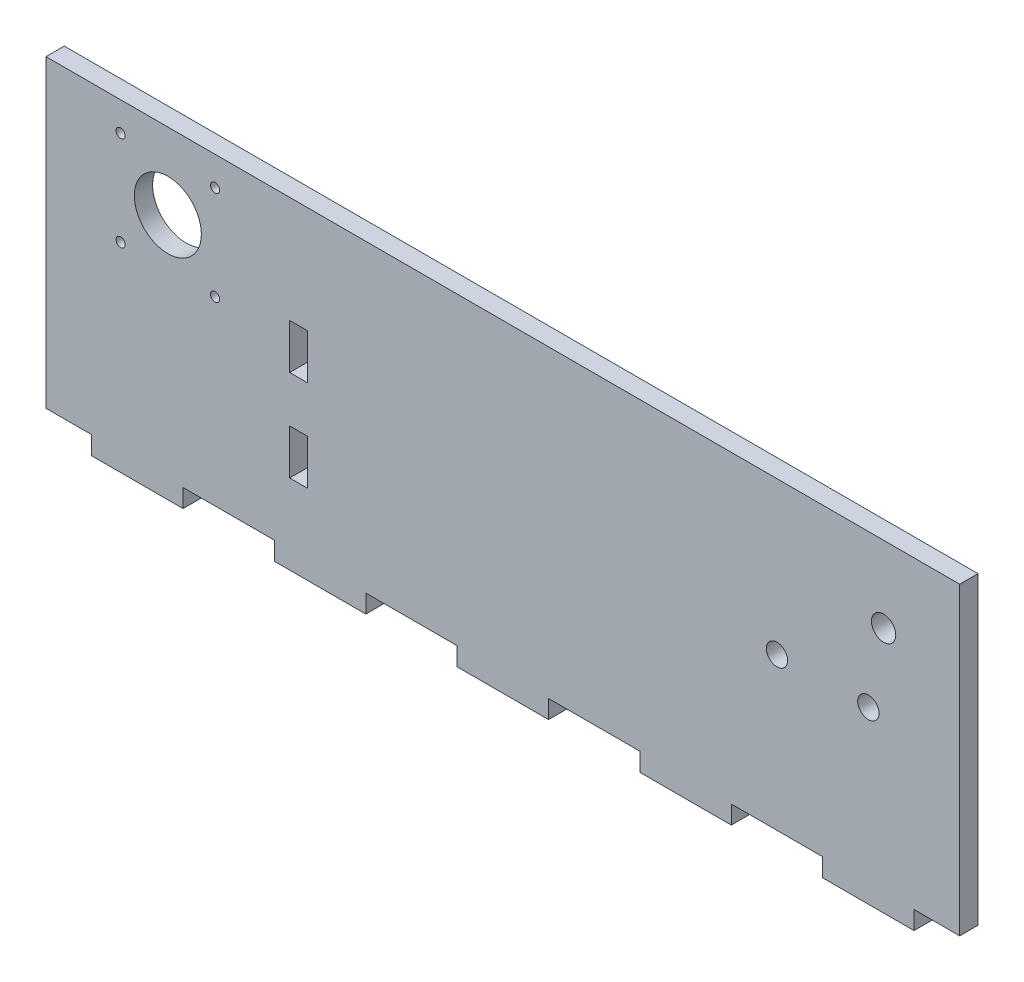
ISO-10303-21;
HEADER;
FILE_DESCRIPTION(('STEP AP214'),'2;1');
FILE_NAME('part.step','',(''),(''),'','','');
FILE_SCHEMA(('AUTOMOTIVE_DESIGN { 1 0 10303 214 1 1 1 1 }'));
ENDSEC;
DATA;
#1=APPLICATION_CONTEXT('core data for automotive mechanical design processes');
#2=APPLICATION_PROTOCOL_DEFINITION('international standard','automotive_design',2000,#1);
#3=PRODUCT_CONTEXT('',#1,'mechanical');
#4=PRODUCT('Part','Part','',(#3));
#5=PRODUCT_RELATED_PRODUCT_CATEGORY('part','',(#4));
#6=PRODUCT_DEFINITION_FORMATION('','',#4);
#7=PRODUCT_DEFINITION_CONTEXT('part definition',#1,'design');
#8=PRODUCT_DEFINITION('design','',#6,#7);
#9=PRODUCT_DEFINITION_SHAPE('','',#8);
#10=(LENGTH_UNIT() NAMED_UNIT(*) SI_UNIT(.MILLI.,.METRE.));
#11=(NAMED_UNIT(*) PLANE_ANGLE_UNIT() SI_UNIT($,.RADIAN.));
#12=(NAMED_UNIT(*) SI_UNIT($,.STERADIAN.) SOLID_ANGLE_UNIT());
#13=UNCERTAINTY_MEASURE_WITH_UNIT(LENGTH_MEASURE(1.E-05),#10,'distance_accuracy_value','');
#14=(GEOMETRIC_REPRESENTATION_CONTEXT(3) GLOBAL_UNCERTAINTY_ASSIGNED_CONTEXT((#13)) GLOBAL_UNIT_ASSIGNED_CONTEXT((#10,
#11,#12)) REPRESENTATION_CONTEXT('',''));
#15=CARTESIAN_POINT('',(0.,0.,0.));
#16=DIRECTION('',(0.,0.,1.));
#17=DIRECTION('',(1.,0.,0.));
#18=AXIS2_PLACEMENT_3D('',#15,#16,#17);
#19=CARTESIAN_POINT('',(150.,-50.,6.));
#20=DIRECTION('',(-1.,0.,0.));
#21=DIRECTION('',(0.,0.,1.));
#22=AXIS2_PLACEMENT_3D('',#19,#20,#21);
#23=PLANE('',#22);
#24=DIRECTION('',(0.,1.,0.));
#25=VECTOR('',#24,1.);
#26=CARTESIAN_POINT('',(150.,-50.,0.));
#27=LINE('',#26,#25);
#28=CARTESIAN_POINT('',(150.,-50.,0.));
#29=VERTEX_POINT('',#28);
#30=CARTESIAN_POINT('',(150.,50.,0.));
#31=VERTEX_POINT('',#30);
#32=EDGE_CURVE('E332',#29,#31,#27,.T.);
#33=ORIENTED_EDGE('',*,*,#32,.T.);
#34=DIRECTION('',(0.,0.,-1.));
#35=VECTOR('',#34,1.);
#36=CARTESIAN_POINT('',(150.,50.,6.));
#37=LINE('',#36,#35);
#38=CARTESIAN_POINT('',(150.,50.,6.));
#39=VERTEX_POINT('',#38);
#40=EDGE_CURVE('E11',#39,#31,#37,.T.);
#41=ORIENTED_EDGE('',*,*,#40,.F.);
#42=DIRECTION('',(0.,1.,0.));
#43=VECTOR('',#42,1.);
#44=CARTESIAN_POINT('',(150.,-50.,6.));
#45=LINE('',#44,#43);
#46=CARTESIAN_POINT('',(150.,-50.,6.));
#47=VERTEX_POINT('',#46);
#48=EDGE_CURVE('E337',#47,#39,#45,.T.);
#49=ORIENTED_EDGE('',*,*,#48,.F.);
#50=DIRECTION('',(0.,0.,-1.));
#51=VECTOR('',#50,1.);
#52=CARTESIAN_POINT('',(150.,-50.,6.));
#53=LINE('',#52,#51);
#54=EDGE_CURVE('E387',#47,#29,#53,.T.);
#55=ORIENTED_EDGE('',*,*,#54,.T.);
#56=EDGE_LOOP('',(#33,#41,#49,#55));
#57=FACE_BOUND('',#56,.T.);
#58=ADVANCED_FACE('F33',(#57),#23,.F.);
#59=CARTESIAN_POINT('',(-150.,50.,6.));
#60=DIRECTION('',(0.,-1.,0.));
#61=DIRECTION('',(0.,0.,-1.));
#62=AXIS2_PLACEMENT_3D('',#59,#60,#61);
#63=PLANE('',#62);
#64=DIRECTION('',(-1.,0.,0.));
#65=VECTOR('',#64,1.);
#66=CARTESIAN_POINT('',(-150.,50.,0.));
#67=LINE('',#66,#65);
#68=CARTESIAN_POINT('',(-150.,50.,0.));
#69=VERTEX_POINT('',#68);
#70=EDGE_CURVE('E390',#31,#69,#67,.T.);
#71=ORIENTED_EDGE('',*,*,#70,.T.);
#72=DIRECTION('',(0.,0.,-1.));
#73=VECTOR('',#72,1.);
#74=CARTESIAN_POINT('',(-150.,50.,6.));
#75=LINE('',#74,#73);
#76=CARTESIAN_POINT('',(-150.,50.,6.));
#77=VERTEX_POINT('',#76);
#78=EDGE_CURVE('E40',#77,#69,#75,.T.);
#79=ORIENTED_EDGE('',*,*,#78,.F.);
#80=DIRECTION('',(-1.,0.,0.));
#81=VECTOR('',#80,1.);
#82=CARTESIAN_POINT('',(-150.,50.,6.));
#83=LINE('',#82,#81);
#84=EDGE_CURVE('E340',#39,#77,#83,.T.);
#85=ORIENTED_EDGE('',*,*,#84,.F.);
#86=ORIENTED_EDGE('',*,*,#40,.T.);
#87=EDGE_LOOP('',(#71,#79,#85,#86));
#88=FACE_BOUND('',#87,.T.);
#89=ADVANCED_FACE('F526',(#88),#63,.F.);
#90=CARTESIAN_POINT('',(-150.,-50.,6.));
#91=DIRECTION('',(1.,0.,0.));
#92=DIRECTION('',(0.,0.,-1.));
#93=AXIS2_PLACEMENT_3D('',#90,#91,#92);
#94=PLANE('',#93);
#95=DIRECTION('',(0.,-1.,0.));
#96=VECTOR('',#95,1.);
#97=CARTESIAN_POINT('',(-150.,-50.,0.));
#98=LINE('',#97,#96);
#99=CARTESIAN_POINT('',(-150.,-50.,0.));
#100=VERTEX_POINT('',#99);
#101=EDGE_CURVE('E392',#69,#100,#98,.T.);
#102=ORIENTED_EDGE('',*,*,#101,.T.);
#103=DIRECTION('',(0.,0.,-1.));
#104=VECTOR('',#103,1.);
#105=CARTESIAN_POINT('',(-150.,-50.,6.));
#106=LINE('',#105,#104);
#107=CARTESIAN_POINT('',(-150.,-50.,6.));
#108=VERTEX_POINT('',#107);
#109=EDGE_CURVE('E497',#108,#100,#106,.T.);
#110=ORIENTED_EDGE('',*,*,#109,.F.);
#111=DIRECTION('',(0.,-1.,0.));
#112=VECTOR('',#111,1.);
#113=CARTESIAN_POINT('',(-150.,-50.,6.));
#114=LINE('',#113,#112);
#115=EDGE_CURVE('E343',#77,#108,#114,.T.);
#116=ORIENTED_EDGE('',*,*,#115,.F.);
#117=ORIENTED_EDGE('',*,*,#78,.T.);
#118=EDGE_LOOP('',(#102,#110,#116,#117));
#119=FACE_BOUND('',#118,.T.);
#120=ADVANCED_FACE('F504',(#119),#94,.F.);
#121=CARTESIAN_POINT('',(-150.,-50.,6.));
#122=DIRECTION('',(0.,1.,0.));
#123=DIRECTION('',(0.,0.,1.));
#124=AXIS2_PLACEMENT_3D('',#121,#122,#123);
#125=PLANE('',#124);
#126=DIRECTION('',(1.,0.,0.));
#127=VECTOR('',#126,1.);
#128=CARTESIAN_POINT('',(-150.,-50.,0.));
#129=LINE('',#128,#127);
#130=CARTESIAN_POINT('',(-135.,-50.,0.));
#131=VERTEX_POINT('',#130);
#132=EDGE_CURVE('E394',#100,#131,#129,.T.);
#133=ORIENTED_EDGE('',*,*,#132,.T.);
#134=DIRECTION('',(0.,0.,-1.));
#135=VECTOR('',#134,1.);
#136=CARTESIAN_POINT('',(-135.,-50.,6.));
#137=LINE('',#136,#135);
#138=CARTESIAN_POINT('',(-135.,-50.,6.));
#139=VERTEX_POINT('',#138);
#140=EDGE_CURVE('E494',#139,#131,#137,.T.);
#141=ORIENTED_EDGE('',*,*,#140,.F.);
#142=DIRECTION('',(1.,0.,0.));
#143=VECTOR('',#142,1.);
#144=CARTESIAN_POINT('',(-150.,-50.,6.));
#145=LINE('',#144,#143);
#146=EDGE_CURVE('E345',#108,#139,#145,.T.);
#147=ORIENTED_EDGE('',*,*,#146,.F.);
#148=ORIENTED_EDGE('',*,*,#109,.T.);
#149=EDGE_LOOP('',(#133,#141,#147,#148));
#150=FACE_BOUND('',#149,.T.);
#151=ADVANCED_FACE('F514',(#150),#125,.F.);
#152=CARTESIAN_POINT('',(-135.,-50.,6.));
#153=DIRECTION('',(1.,0.,0.));
#154=DIRECTION('',(0.,0.,-1.));
#155=AXIS2_PLACEMENT_3D('',#152,#153,#154);
#156=PLANE('',#155);
#157=DIRECTION('',(0.,-1.,0.));
#158=VECTOR('',#157,1.);
#159=CARTESIAN_POINT('',(-135.,-50.,0.));
#160=LINE('',#159,#158);
#161=CARTESIAN_POINT('',(-135.,-56.,0.));
#162=VERTEX_POINT('',#161);
#163=EDGE_CURVE('E396',#131,#162,#160,.T.);
#164=ORIENTED_EDGE('',*,*,#163,.T.);
#165=DIRECTION('',(0.,0.,-1.));
#166=VECTOR('',#165,1.);
#167=CARTESIAN_POINT('',(-135.,-56.,6.));
#168=LINE('',#167,#166);
#169=CARTESIAN_POINT('',(-135.,-56.,6.));
#170=VERTEX_POINT('',#169);
#171=EDGE_CURVE('E491',#170,#162,#168,.T.);
#172=ORIENTED_EDGE('',*,*,#171,.F.);
#173=DIRECTION('',(0.,-1.,0.));
#174=VECTOR('',#173,1.);
#175=CARTESIAN_POINT('',(-135.,-50.,6.));
#176=LINE('',#175,#174);
#177=EDGE_CURVE('E347',#139,#170,#176,.T.);
#178=ORIENTED_EDGE('',*,*,#177,.F.);
#179=ORIENTED_EDGE('',*,*,#140,.T.);
#180=EDGE_LOOP('',(#164,#172,#178,#179));
#181=FACE_BOUND('',#180,.T.);
#182=ADVANCED_FACE('F518',(#181),#156,.F.);
#183=CARTESIAN_POINT('',(-135.,-56.,6.));
#184=DIRECTION('',(0.,1.,0.));
#185=DIRECTION('',(-1.,0.,0.));
#186=AXIS2_PLACEMENT_3D('',#183,#184,#185);
#187=PLANE('',#186);
#188=DIRECTION('',(1.,0.,0.));
#189=VECTOR('',#188,1.);
#190=CARTESIAN_POINT('',(-135.,-56.,0.));
#191=LINE('',#190,#189);
#192=CARTESIAN_POINT('',(-105.,-56.,0.));
#193=VERTEX_POINT('',#192);
#194=EDGE_CURVE('E398',#162,#193,#191,.T.);
#195=ORIENTED_EDGE('',*,*,#194,.T.);
#196=DIRECTION('',(0.,0.,-1.));
#197=VECTOR('',#196,1.);
#198=CARTESIAN_POINT('',(-105.,-56.,6.));
#199=LINE('',#198,#197);
#200=CARTESIAN_POINT('',(-105.,-56.,6.));
#201=VERTEX_POINT('',#200);
#202=EDGE_CURVE('E488',#201,#193,#199,.T.);
#203=ORIENTED_EDGE('',*,*,#202,.F.);
#204=DIRECTION('',(1.,0.,0.));
#205=VECTOR('',#204,1.);
#206=CARTESIAN_POINT('',(-135.,-56.,6.));
#207=LINE('',#206,#205);
#208=EDGE_CURVE('E349',#170,#201,#207,.T.);
#209=ORIENTED_EDGE('',*,*,#208,.F.);
#210=ORIENTED_EDGE('',*,*,#171,.T.);
#211=EDGE_LOOP('',(#195,#203,#209,#210));
#212=FACE_BOUND('',#211,.T.);
#213=ADVANCED_FACE('F619',(#212),#187,.F.);
#214=CARTESIAN_POINT('',(-105.,-50.,6.));
#215=DIRECTION('',(-1.,0.,0.));
#216=DIRECTION('',(0.,0.,1.));
#217=AXIS2_PLACEMENT_3D('',#214,#215,#216);
#218=PLANE('',#217);
#219=DIRECTION('',(0.,1.,0.));
#220=VECTOR('',#219,1.);
#221=CARTESIAN_POINT('',(-105.,-50.,0.));
#222=LINE('',#221,#220);
#223=CARTESIAN_POINT('',(-105.,-50.,0.));
#224=VERTEX_POINT('',#223);
#225=EDGE_CURVE('E400',#193,#224,#222,.T.);
#226=ORIENTED_EDGE('',*,*,#225,.T.);
#227=DIRECTION('',(0.,0.,-1.));
#228=VECTOR('',#227,1.);
#229=CARTESIAN_POINT('',(-105.,-50.,6.));
#230=LINE('',#229,#228);
#231=CARTESIAN_POINT('',(-105.,-50.,6.));
#232=VERTEX_POINT('',#231);
#233=EDGE_CURVE('E485',#232,#224,#230,.T.);
#234=ORIENTED_EDGE('',*,*,#233,.F.);
#235=DIRECTION('',(0.,1.,0.));
#236=VECTOR('',#235,1.);
#237=CARTESIAN_POINT('',(-105.,-50.,6.));
#238=LINE('',#237,#236);
#239=EDGE_CURVE('E351',#201,#232,#238,.T.);
#240=ORIENTED_EDGE('',*,*,#239,.F.);
#241=ORIENTED_EDGE('',*,*,#202,.T.);
#242=EDGE_LOOP('',(#226,#234,#240,#241));
#243=FACE_BOUND('',#242,.T.);
#244=ADVANCED_FACE('F617',(#243),#218,.F.);
#245=CARTESIAN_POINT('',(-105.,-50.,6.));
#246=DIRECTION('',(0.,1.,0.));
#247=DIRECTION('',(-1.,0.,0.));
#248=AXIS2_PLACEMENT_3D('',#245,#246,#247);
#249=PLANE('',#248);
#250=DIRECTION('',(1.,0.,0.));
#251=VECTOR('',#250,1.);
#252=CARTESIAN_POINT('',(-105.,-50.,0.));
#253=LINE('',#252,#251);
#254=CARTESIAN_POINT('',(-75.,-50.,0.));
#255=VERTEX_POINT('',#254);
#256=EDGE_CURVE('E402',#224,#255,#253,.T.);
#257=ORIENTED_EDGE('',*,*,#256,.T.);
#258=DIRECTION('',(0.,0.,-1.));
#259=VECTOR('',#258,1.);
#260=CARTESIAN_POINT('',(-75.,-50.,6.));
#261=LINE('',#260,#259);
#262=CARTESIAN_POINT('',(-75.,-50.,6.));
#263=VERTEX_POINT('',#262);
#264=EDGE_CURVE('E482',#263,#255,#261,.T.);
#265=ORIENTED_EDGE('',*,*,#264,.F.);
#266=DIRECTION('',(1.,0.,0.));
#267=VECTOR('',#266,1.);
#268=CARTESIAN_POINT('',(-105.,-50.,6.));
#269=LINE('',#268,#267);
#270=EDGE_CURVE('E353',#232,#263,#269,.T.);
#271=ORIENTED_EDGE('',*,*,#270,.F.);
#272=ORIENTED_EDGE('',*,*,#233,.T.);
#273=EDGE_LOOP('',(#257,#265,#271,#272));
#274=FACE_BOUND('',#273,.T.);
#275=ADVANCED_FACE('F613',(#274),#249,.F.);
#276=CARTESIAN_POINT('',(-75.,-50.,6.));
#277=DIRECTION('',(1.,0.,0.));
#278=DIRECTION('',(0.,0.,-1.));
#279=AXIS2_PLACEMENT_3D('',#276,#277,#278);
#280=PLANE('',#279);
#281=DIRECTION('',(0.,-1.,0.));
#282=VECTOR('',#281,1.);
#283=CARTESIAN_POINT('',(-75.,-50.,0.));
#284=LINE('',#283,#282);
#285=CARTESIAN_POINT('',(-75.,-56.,0.));
#286=VERTEX_POINT('',#285);
#287=EDGE_CURVE('E404',#255,#286,#284,.T.);
#288=ORIENTED_EDGE('',*,*,#287,.T.);
#289=DIRECTION('',(0.,0.,-1.));
#290=VECTOR('',#289,1.);
#291=CARTESIAN_POINT('',(-75.,-56.,6.));
#292=LINE('',#291,#290);
#293=CARTESIAN_POINT('',(-75.,-56.,6.));
#294=VERTEX_POINT('',#293);
#295=EDGE_CURVE('E479',#294,#286,#292,.T.);
#296=ORIENTED_EDGE('',*,*,#295,.F.);
#297=DIRECTION('',(0.,-1.,0.));
#298=VECTOR('',#297,1.);
#299=CARTESIAN_POINT('',(-75.,-50.,6.));
#300=LINE('',#299,#298);
#301=EDGE_CURVE('E355',#263,#294,#300,.T.);
#302=ORIENTED_EDGE('',*,*,#301,.F.);
#303=ORIENTED_EDGE('',*,*,#264,.T.);
#304=EDGE_LOOP('',(#288,#296,#302,#303));
#305=FACE_BOUND('',#304,.T.);
#306=ADVANCED_FACE('F608',(#305),#280,.F.);
#307=CARTESIAN_POINT('',(-75.,-56.,6.));
#308=DIRECTION('',(0.,1.,0.));
#309=DIRECTION('',(-1.,0.,0.));
#310=AXIS2_PLACEMENT_3D('',#307,#308,#309);
#311=PLANE('',#310);
#312=DIRECTION('',(1.,0.,0.));
#313=VECTOR('',#312,1.);
#314=CARTESIAN_POINT('',(-75.,-56.,0.));
#315=LINE('',#314,#313);
#316=CARTESIAN_POINT('',(-45.,-56.,0.));
#317=VERTEX_POINT('',#316);
#318=EDGE_CURVE('E406',#286,#317,#315,.T.);
#319=ORIENTED_EDGE('',*,*,#318,.T.);
#320=DIRECTION('',(0.,0.,-1.));
#321=VECTOR('',#320,1.);
#322=CARTESIAN_POINT('',(-45.,-56.,6.));
#323=LINE('',#322,#321);
#324=CARTESIAN_POINT('',(-45.,-56.,6.));
#325=VERTEX_POINT('',#324);
#326=EDGE_CURVE('E476',#325,#317,#323,.T.);
#327=ORIENTED_EDGE('',*,*,#326,.F.);
#328=DIRECTION('',(1.,0.,0.));
#329=VECTOR('',#328,1.);
#330=CARTESIAN_POINT('',(-75.,-56.,6.));
#331=LINE('',#330,#329);
#332=EDGE_CURVE('E357',#294,#325,#331,.T.);
#333=ORIENTED_EDGE('',*,*,#332,.F.);
#334=ORIENTED_EDGE('',*,*,#295,.T.);
#335=EDGE_LOOP('',(#319,#327,#333,#334));
#336=FACE_BOUND('',#335,.T.);
#337=ADVANCED_FACE('F602',(#336),#311,.F.);
#338=CARTESIAN_POINT('',(-45.,-50.,6.));
#339=DIRECTION('',(-1.,0.,0.));
#340=DIRECTION('',(0.,0.,1.));
#341=AXIS2_PLACEMENT_3D('',#338,#339,#340);
#342=PLANE('',#341);
#343=DIRECTION('',(0.,1.,0.));
#344=VECTOR('',#343,1.);
#345=CARTESIAN_POINT('',(-45.,-50.,0.));
#346=LINE('',#345,#344);
#347=CARTESIAN_POINT('',(-45.,-50.,0.));
#348=VERTEX_POINT('',#347);
#349=EDGE_CURVE('E408',#317,#348,#346,.T.);
#350=ORIENTED_EDGE('',*,*,#349,.T.);
#351=DIRECTION('',(0.,0.,-1.));
#352=VECTOR('',#351,1.);
#353=CARTESIAN_POINT('',(-45.,-50.,6.));
#354=LINE('',#353,#352);
#355=CARTESIAN_POINT('',(-45.,-50.,6.));
#356=VERTEX_POINT('',#355);
#357=EDGE_CURVE('E473',#356,#348,#354,.T.);
#358=ORIENTED_EDGE('',*,*,#357,.F.);
#359=DIRECTION('',(0.,1.,0.));
#360=VECTOR('',#359,1.);
#361=CARTESIAN_POINT('',(-45.,-50.,6.));
#362=LINE('',#361,#360);
#363=EDGE_CURVE('E359',#325,#356,#362,.T.);
#364=ORIENTED_EDGE('',*,*,#363,.F.);
#365=ORIENTED_EDGE('',*,*,#326,.T.);
#366=EDGE_LOOP('',(#350,#358,#364,#365));
#367=FACE_BOUND('',#366,.T.);
#368=ADVANCED_FACE('F598',(#367),#342,.F.);
#369=CARTESIAN_POINT('',(-45.,-50.,6.));
#370=DIRECTION('',(0.,1.,0.));
#371=DIRECTION('',(-1.,0.,0.));
#372=AXIS2_PLACEMENT_3D('',#369,#370,#371);
#373=PLANE('',#372);
#374=DIRECTION('',(1.,0.,0.));
#375=VECTOR('',#374,1.);
#376=CARTESIAN_POINT('',(-45.,-50.,0.));
#377=LINE('',#376,#375);
#378=CARTESIAN_POINT('',(-15.,-50.,0.));
#379=VERTEX_POINT('',#378);
#380=EDGE_CURVE('E410',#348,#379,#377,.T.);
#381=ORIENTED_EDGE('',*,*,#380,.T.);
#382=DIRECTION('',(0.,0.,-1.));
#383=VECTOR('',#382,1.);
#384=CARTESIAN_POINT('',(-15.,-50.,6.));
#385=LINE('',#384,#383);
#386=CARTESIAN_POINT('',(-15.,-50.,6.));
#387=VERTEX_POINT('',#386);
#388=EDGE_CURVE('E470',#387,#379,#385,.T.);
#389=ORIENTED_EDGE('',*,*,#388,.F.);
#390=DIRECTION('',(1.,0.,0.));
#391=VECTOR('',#390,1.);
#392=CARTESIAN_POINT('',(-45.,-50.,6.));
#393=LINE('',#392,#391);
#394=EDGE_CURVE('E361',#356,#387,#393,.T.);
#395=ORIENTED_EDGE('',*,*,#394,.F.);
#396=ORIENTED_EDGE('',*,*,#357,.T.);
#397=EDGE_LOOP('',(#381,#389,#395,#396));
#398=FACE_BOUND('',#397,.T.);
#399=ADVANCED_FACE('F593',(#398),#373,.F.);
#400=CARTESIAN_POINT('',(-15.,-50.,6.));
#401=DIRECTION('',(1.,0.,0.));
#402=DIRECTION('',(0.,0.,-1.));
#403=AXIS2_PLACEMENT_3D('',#400,#401,#402);
#404=PLANE('',#403);
#405=DIRECTION('',(0.,-1.,0.));
#406=VECTOR('',#405,1.);
#407=CARTESIAN_POINT('',(-15.,-50.,0.));
#408=LINE('',#407,#406);
#409=CARTESIAN_POINT('',(-15.,-56.,0.));
#410=VERTEX_POINT('',#409);
#411=EDGE_CURVE('E412',#379,#410,#408,.T.);
#412=ORIENTED_EDGE('',*,*,#411,.T.);
#413=DIRECTION('',(0.,0.,-1.));
#414=VECTOR('',#413,1.);
#415=CARTESIAN_POINT('',(-15.,-56.,6.));
#416=LINE('',#415,#414);
#417=CARTESIAN_POINT('',(-15.,-56.,6.));
#418=VERTEX_POINT('',#417);
#419=EDGE_CURVE('E467',#418,#410,#416,.T.);
#420=ORIENTED_EDGE('',*,*,#419,.F.);
#421=DIRECTION('',(0.,-1.,0.));
#422=VECTOR('',#421,1.);
#423=CARTESIAN_POINT('',(-15.,-50.,6.));
#424=LINE('',#423,#422);
#425=EDGE_CURVE('E363',#387,#418,#424,.T.);
#426=ORIENTED_EDGE('',*,*,#425,.F.);
#427=ORIENTED_EDGE('',*,*,#388,.T.);
#428=EDGE_LOOP('',(#412,#420,#426,#427));
#429=FACE_BOUND('',#428,.T.);
#430=ADVANCED_FACE('F587',(#429),#404,.F.);
#431=CARTESIAN_POINT('',(-15.,-56.,6.));
#432=DIRECTION('',(0.,1.,0.));
#433=DIRECTION('',(-1.,0.,0.));
#434=AXIS2_PLACEMENT_3D('',#431,#432,#433);
#435=PLANE('',#434);
#436=DIRECTION('',(1.,0.,0.));
#437=VECTOR('',#436,1.);
#438=CARTESIAN_POINT('',(-15.,-56.,0.));
#439=LINE('',#438,#437);
#440=CARTESIAN_POINT('',(15.,-56.,0.));
#441=VERTEX_POINT('',#440);
#442=EDGE_CURVE('E414',#410,#441,#439,.T.);
#443=ORIENTED_EDGE('',*,*,#442,.T.);
#444=DIRECTION('',(0.,0.,-1.));
#445=VECTOR('',#444,1.);
#446=CARTESIAN_POINT('',(15.,-56.,6.));
#447=LINE('',#446,#445);
#448=CARTESIAN_POINT('',(15.,-56.,6.));
#449=VERTEX_POINT('',#448);
#450=EDGE_CURVE('E464',#449,#441,#447,.T.);
#451=ORIENTED_EDGE('',*,*,#450,.F.);
#452=DIRECTION('',(1.,0.,0.));
#453=VECTOR('',#452,1.);
#454=CARTESIAN_POINT('',(-15.,-56.,6.));
#455=LINE('',#454,#453);
#456=EDGE_CURVE('E365',#418,#449,#455,.T.);
#457=ORIENTED_EDGE('',*,*,#456,.F.);
#458=ORIENTED_EDGE('',*,*,#419,.T.);
#459=EDGE_LOOP('',(#443,#451,#457,#458));
#460=FACE_BOUND('',#459,.T.);
#461=ADVANCED_FACE('F583',(#460),#435,.F.);
#462=CARTESIAN_POINT('',(15.,-50.,6.));
#463=DIRECTION('',(-1.,0.,0.));
#464=DIRECTION('',(0.,0.,1.));
#465=AXIS2_PLACEMENT_3D('',#462,#463,#464);
#466=PLANE('',#465);
#467=DIRECTION('',(0.,1.,0.));
#468=VECTOR('',#467,1.);
#469=CARTESIAN_POINT('',(15.,-50.,0.));
#470=LINE('',#469,#468);
#471=CARTESIAN_POINT('',(15.,-50.,0.));
#472=VERTEX_POINT('',#471);
#473=EDGE_CURVE('E416',#441,#472,#470,.T.);
#474=ORIENTED_EDGE('',*,*,#473,.T.);
#475=DIRECTION('',(0.,0.,-1.));
#476=VECTOR('',#475,1.);
#477=CARTESIAN_POINT('',(15.,-50.,6.));
#478=LINE('',#477,#476);
#479=CARTESIAN_POINT('',(15.,-50.,6.));
#480=VERTEX_POINT('',#479);
#481=EDGE_CURVE('E461',#480,#472,#478,.T.);
#482=ORIENTED_EDGE('',*,*,#481,.F.);
#483=DIRECTION('',(0.,1.,0.));
#484=VECTOR('',#483,1.);
#485=CARTESIAN_POINT('',(15.,-50.,6.));
#486=LINE('',#485,#484);
#487=EDGE_CURVE('E367',#449,#480,#486,.T.);
#488=ORIENTED_EDGE('',*,*,#487,.F.);
#489=ORIENTED_EDGE('',*,*,#450,.T.);
#490=EDGE_LOOP('',(#474,#482,#488,#489));
#491=FACE_BOUND('',#490,.T.);
#492=ADVANCED_FACE('F578',(#491),#466,.F.);
#493=CARTESIAN_POINT('',(15.,-50.,6.));
#494=DIRECTION('',(0.,1.,0.));
#495=DIRECTION('',(-1.,0.,0.));
#496=AXIS2_PLACEMENT_3D('',#493,#494,#495);
#497=PLANE('',#496);
#498=DIRECTION('',(1.,0.,0.));
#499=VECTOR('',#498,1.);
#500=CARTESIAN_POINT('',(15.,-50.,0.));
#501=LINE('',#500,#499);
#502=CARTESIAN_POINT('',(45.,-50.,0.));
#503=VERTEX_POINT('',#502);
#504=EDGE_CURVE('E418',#472,#503,#501,.T.);
#505=ORIENTED_EDGE('',*,*,#504,.T.);
#506=DIRECTION('',(0.,0.,-1.));
#507=VECTOR('',#506,1.);
#508=CARTESIAN_POINT('',(45.,-50.,6.));
#509=LINE('',#508,#507);
#510=CARTESIAN_POINT('',(45.,-50.,6.));
#511=VERTEX_POINT('',#510);
#512=EDGE_CURVE('E458',#511,#503,#509,.T.);
#513=ORIENTED_EDGE('',*,*,#512,.F.);
#514=DIRECTION('',(1.,0.,0.));
#515=VECTOR('',#514,1.);
#516=CARTESIAN_POINT('',(15.,-50.,6.));
#517=LINE('',#516,#515);
#518=EDGE_CURVE('E369',#480,#511,#517,.T.);
#519=ORIENTED_EDGE('',*,*,#518,.F.);
#520=ORIENTED_EDGE('',*,*,#481,.T.);
#521=EDGE_LOOP('',(#505,#513,#519,#520));
#522=FACE_BOUND('',#521,.T.);
#523=ADVANCED_FACE('F572',(#522),#497,.F.);
#524=CARTESIAN_POINT('',(45.,-50.,6.));
#525=DIRECTION('',(1.,0.,0.));
#526=DIRECTION('',(0.,0.,-1.));
#527=AXIS2_PLACEMENT_3D('',#524,#525,#526);
#528=PLANE('',#527);
#529=DIRECTION('',(0.,-1.,0.));
#530=VECTOR('',#529,1.);
#531=CARTESIAN_POINT('',(45.,-50.,0.));
#532=LINE('',#531,#530);
#533=CARTESIAN_POINT('',(45.,-56.,0.));
#534=VERTEX_POINT('',#533);
#535=EDGE_CURVE('E420',#503,#534,#532,.T.);
#536=ORIENTED_EDGE('',*,*,#535,.T.);
#537=DIRECTION('',(0.,0.,-1.));
#538=VECTOR('',#537,1.);
#539=CARTESIAN_POINT('',(45.,-56.,6.));
#540=LINE('',#539,#538);
#541=CARTESIAN_POINT('',(45.,-56.,6.));
#542=VERTEX_POINT('',#541);
#543=EDGE_CURVE('E455',#542,#534,#540,.T.);
#544=ORIENTED_EDGE('',*,*,#543,.F.);
#545=DIRECTION('',(0.,-1.,0.));
#546=VECTOR('',#545,1.);
#547=CARTESIAN_POINT('',(45.,-50.,6.));
#548=LINE('',#547,#546);
#549=EDGE_CURVE('E371',#511,#542,#548,.T.);
#550=ORIENTED_EDGE('',*,*,#549,.F.);
#551=ORIENTED_EDGE('',*,*,#512,.T.);
#552=EDGE_LOOP('',(#536,#544,#550,#551));
#553=FACE_BOUND('',#552,.T.);
#554=ADVANCED_FACE('F568',(#553),#528,.F.);
#555=CARTESIAN_POINT('',(45.,-56.,6.));
#556=DIRECTION('',(0.,1.,0.));
#557=DIRECTION('',(-1.,0.,0.));
#558=AXIS2_PLACEMENT_3D('',#555,#556,#557);
#559=PLANE('',#558);
#560=DIRECTION('',(1.,0.,0.));
#561=VECTOR('',#560,1.);
#562=CARTESIAN_POINT('',(45.,-56.,0.));
#563=LINE('',#562,#561);
#564=CARTESIAN_POINT('',(75.,-56.,0.));
#565=VERTEX_POINT('',#564);
#566=EDGE_CURVE('E422',#534,#565,#563,.T.);
#567=ORIENTED_EDGE('',*,*,#566,.T.);
#568=DIRECTION('',(0.,0.,-1.));
#569=VECTOR('',#568,1.);
#570=CARTESIAN_POINT('',(75.,-56.,6.));
#571=LINE('',#570,#569);
#572=CARTESIAN_POINT('',(75.,-56.,6.));
#573=VERTEX_POINT('',#572);
#574=EDGE_CURVE('E452',#573,#565,#571,.T.);
#575=ORIENTED_EDGE('',*,*,#574,.F.);
#576=DIRECTION('',(1.,0.,0.));
#577=VECTOR('',#576,1.);
#578=CARTESIAN_POINT('',(45.,-56.,6.));
#579=LINE('',#578,#577);
#580=EDGE_CURVE('E373',#542,#573,#579,.T.);
#581=ORIENTED_EDGE('',*,*,#580,.F.);
#582=ORIENTED_EDGE('',*,*,#543,.T.);
#583=EDGE_LOOP('',(#567,#575,#581,#582));
#584=FACE_BOUND('',#583,.T.);
#585=ADVANCED_FACE('F563',(#584),#559,.F.);
#586=CARTESIAN_POINT('',(75.,-50.,6.));
#587=DIRECTION('',(-1.,0.,0.));
#588=DIRECTION('',(0.,0.,1.));
#589=AXIS2_PLACEMENT_3D('',#586,#587,#588);
#590=PLANE('',#589);
#591=DIRECTION('',(0.,1.,0.));
#592=VECTOR('',#591,1.);
#593=CARTESIAN_POINT('',(75.,-50.,0.));
#594=LINE('',#593,#592);
#595=CARTESIAN_POINT('',(75.,-50.,0.));
#596=VERTEX_POINT('',#595);
#597=EDGE_CURVE('E424',#565,#596,#594,.T.);
#598=ORIENTED_EDGE('',*,*,#597,.T.);
#599=DIRECTION('',(0.,0.,-1.));
#600=VECTOR('',#599,1.);
#601=CARTESIAN_POINT('',(75.,-50.,6.));
#602=LINE('',#601,#600);
#603=CARTESIAN_POINT('',(75.,-50.,6.));
#604=VERTEX_POINT('',#603);
#605=EDGE_CURVE('E449',#604,#596,#602,.T.);
#606=ORIENTED_EDGE('',*,*,#605,.F.);
#607=DIRECTION('',(0.,1.,0.));
#608=VECTOR('',#607,1.);
#609=CARTESIAN_POINT('',(75.,-50.,6.));
#610=LINE('',#609,#608);
#611=EDGE_CURVE('E375',#573,#604,#610,.T.);
#612=ORIENTED_EDGE('',*,*,#611,.F.);
#613=ORIENTED_EDGE('',*,*,#574,.T.);
#614=EDGE_LOOP('',(#598,#606,#612,#613));
#615=FACE_BOUND('',#614,.T.);
#616=ADVANCED_FACE('F557',(#615),#590,.F.);
#617=CARTESIAN_POINT('',(75.,-50.,6.));
#618=DIRECTION('',(0.,1.,0.));
#619=DIRECTION('',(-1.,0.,0.));
#620=AXIS2_PLACEMENT_3D('',#617,#618,#619);
#621=PLANE('',#620);
#622=DIRECTION('',(1.,0.,0.));
#623=VECTOR('',#622,1.);
#624=CARTESIAN_POINT('',(75.,-50.,0.));
#625=LINE('',#624,#623);
#626=CARTESIAN_POINT('',(105.,-50.,0.));
#627=VERTEX_POINT('',#626);
#628=EDGE_CURVE('E426',#596,#627,#625,.T.);
#629=ORIENTED_EDGE('',*,*,#628,.T.);
#630=DIRECTION('',(0.,0.,-1.));
#631=VECTOR('',#630,1.);
#632=CARTESIAN_POINT('',(105.,-50.,6.));
#633=LINE('',#632,#631);
#634=CARTESIAN_POINT('',(105.,-50.,6.));
#635=VERTEX_POINT('',#634);
#636=EDGE_CURVE('E446',#635,#627,#633,.T.);
#637=ORIENTED_EDGE('',*,*,#636,.F.);
#638=DIRECTION('',(1.,0.,0.));
#639=VECTOR('',#638,1.);
#640=CARTESIAN_POINT('',(75.,-50.,6.));
#641=LINE('',#640,#639);
#642=EDGE_CURVE('E377',#604,#635,#641,.T.);
#643=ORIENTED_EDGE('',*,*,#642,.F.);
#644=ORIENTED_EDGE('',*,*,#605,.T.);
#645=EDGE_LOOP('',(#629,#637,#643,#644));
#646=FACE_BOUND('',#645,.T.);
#647=ADVANCED_FACE('F553',(#646),#621,.F.);
#648=CARTESIAN_POINT('',(105.,-50.,6.));
#649=DIRECTION('',(1.,0.,0.));
#650=DIRECTION('',(0.,0.,-1.));
#651=AXIS2_PLACEMENT_3D('',#648,#649,#650);
#652=PLANE('',#651);
#653=DIRECTION('',(0.,-1.,0.));
#654=VECTOR('',#653,1.);
#655=CARTESIAN_POINT('',(105.,-50.,0.));
#656=LINE('',#655,#654);
#657=CARTESIAN_POINT('',(105.,-56.,0.));
#658=VERTEX_POINT('',#657);
#659=EDGE_CURVE('E428',#627,#658,#656,.T.);
#660=ORIENTED_EDGE('',*,*,#659,.T.);
#661=DIRECTION('',(0.,0.,-1.));
#662=VECTOR('',#661,1.);
#663=CARTESIAN_POINT('',(105.,-56.,6.));
#664=LINE('',#663,#662);
#665=CARTESIAN_POINT('',(105.,-56.,6.));
#666=VERTEX_POINT('',#665);
#667=EDGE_CURVE('E443',#666,#658,#664,.T.);
#668=ORIENTED_EDGE('',*,*,#667,.F.);
#669=DIRECTION('',(0.,-1.,0.));
#670=VECTOR('',#669,1.);
#671=CARTESIAN_POINT('',(105.,-50.,6.));
#672=LINE('',#671,#670);
#673=EDGE_CURVE('E379',#635,#666,#672,.T.);
#674=ORIENTED_EDGE('',*,*,#673,.F.);
#675=ORIENTED_EDGE('',*,*,#636,.T.);
#676=EDGE_LOOP('',(#660,#668,#674,#675));
#677=FACE_BOUND('',#676,.T.);
#678=ADVANCED_FACE('F548',(#677),#652,.F.);
#679=CARTESIAN_POINT('',(105.,-56.,6.));
#680=DIRECTION('',(0.,1.,0.));
#681=DIRECTION('',(-1.,0.,0.));
#682=AXIS2_PLACEMENT_3D('',#679,#680,#681);
#683=PLANE('',#682);
#684=DIRECTION('',(1.,0.,0.));
#685=VECTOR('',#684,1.);
#686=CARTESIAN_POINT('',(105.,-56.,0.));
#687=LINE('',#686,#685);
#688=CARTESIAN_POINT('',(135.,-56.,0.));
#689=VERTEX_POINT('',#688);
#690=EDGE_CURVE('E430',#658,#689,#687,.T.);
#691=ORIENTED_EDGE('',*,*,#690,.T.);
#692=DIRECTION('',(0.,0.,-1.));
#693=VECTOR('',#692,1.);
#694=CARTESIAN_POINT('',(135.,-56.,6.));
#695=LINE('',#694,#693);
#696=CARTESIAN_POINT('',(135.,-56.,6.));
#697=VERTEX_POINT('',#696);
#698=EDGE_CURVE('E440',#697,#689,#695,.T.);
#699=ORIENTED_EDGE('',*,*,#698,.F.);
#700=DIRECTION('',(1.,0.,0.));
#701=VECTOR('',#700,1.);
#702=CARTESIAN_POINT('',(105.,-56.,6.));
#703=LINE('',#702,#701);
#704=EDGE_CURVE('E381',#666,#697,#703,.T.);
#705=ORIENTED_EDGE('',*,*,#704,.F.);
#706=ORIENTED_EDGE('',*,*,#667,.T.);
#707=EDGE_LOOP('',(#691,#699,#705,#706));
#708=FACE_BOUND('',#707,.T.);
#709=ADVANCED_FACE('F542',(#708),#683,.F.);
#710=CARTESIAN_POINT('',(135.,-50.,6.));
#711=DIRECTION('',(-1.,0.,0.));
#712=DIRECTION('',(0.,0.,1.));
#713=AXIS2_PLACEMENT_3D('',#710,#711,#712);
#714=PLANE('',#713);
#715=DIRECTION('',(0.,1.,0.));
#716=VECTOR('',#715,1.);
#717=CARTESIAN_POINT('',(135.,-50.,0.));
#718=LINE('',#717,#716);
#719=CARTESIAN_POINT('',(135.,-50.,0.));
#720=VERTEX_POINT('',#719);
#721=EDGE_CURVE('E432',#689,#720,#718,.T.);
#722=ORIENTED_EDGE('',*,*,#721,.T.);
#723=DIRECTION('',(0.,0.,-1.));
#724=VECTOR('',#723,1.);
#725=CARTESIAN_POINT('',(135.,-50.,6.));
#726=LINE('',#725,#724);
#727=CARTESIAN_POINT('',(135.,-50.,6.));
#728=VERTEX_POINT('',#727);
#729=EDGE_CURVE('E437',#728,#720,#726,.T.);
#730=ORIENTED_EDGE('',*,*,#729,.F.);
#731=DIRECTION('',(0.,1.,0.));
#732=VECTOR('',#731,1.);
#733=CARTESIAN_POINT('',(135.,-50.,6.));
#734=LINE('',#733,#732);
#735=EDGE_CURVE('E383',#697,#728,#734,.T.);
#736=ORIENTED_EDGE('',*,*,#735,.F.);
#737=ORIENTED_EDGE('',*,*,#698,.T.);
#738=EDGE_LOOP('',(#722,#730,#736,#737));
#739=FACE_BOUND('',#738,.T.);
#740=ADVANCED_FACE('F538',(#739),#714,.F.);
#741=CARTESIAN_POINT('',(135.,-50.,6.));
#742=DIRECTION('',(0.,1.,0.));
#743=DIRECTION('',(-1.,0.,0.));
#744=AXIS2_PLACEMENT_3D('',#741,#742,#743);
#745=PLANE('',#744);
#746=DIRECTION('',(1.,0.,0.));
#747=VECTOR('',#746,1.);
#748=CARTESIAN_POINT('',(135.,-50.,0.));
#749=LINE('',#748,#747);
#750=EDGE_CURVE('E341',#720,#29,#749,.T.);
#751=ORIENTED_EDGE('',*,*,#750,.T.);
#752=ORIENTED_EDGE('',*,*,#54,.F.);
#753=DIRECTION('',(1.,0.,0.));
#754=VECTOR('',#753,1.);
#755=CARTESIAN_POINT('',(135.,-50.,6.));
#756=LINE('',#755,#754);
#757=EDGE_CURVE('E385',#728,#47,#756,.T.);
#758=ORIENTED_EDGE('',*,*,#757,.F.);
#759=ORIENTED_EDGE('',*,*,#729,.T.);
#760=EDGE_LOOP('',(#751,#752,#758,#759));
#761=FACE_BOUND('',#760,.T.);
#762=ADVANCED_FACE('F533',(#761),#745,.F.);
#763=CARTESIAN_POINT('',(0.,0.,6.));
#764=DIRECTION('',(0.,0.,-1.));
#765=DIRECTION('',(-1.,0.,0.));
#766=AXIS2_PLACEMENT_3D('',#763,#764,#765);
#767=PLANE('',#766);
#768=CARTESIAN_POINT('',(-125.5,40.5,6.));
#769=DIRECTION('',(0.,0.,1.));
#770=DIRECTION('',(1.,0.,0.));
#771=AXIS2_PLACEMENT_3D('',#768,#769,#770);
#772=CIRCLE('',#771,1.5);
#773=CARTESIAN_POINT('',(-124.,40.5,6.));
#774=VERTEX_POINT('',#773);
#775=EDGE_CURVE('E336',#774,#774,#772,.T.);
#776=ORIENTED_EDGE('',*,*,#775,.F.);
#777=EDGE_LOOP('',(#776));
#778=FACE_BOUND('',#777,.T.);
#779=CARTESIAN_POINT('',(-94.5,40.5,6.));
#780=DIRECTION('',(0.,0.,1.));
#781=DIRECTION('',(1.,0.,0.));
#782=AXIS2_PLACEMENT_3D('',#779,#780,#781);
#783=CIRCLE('',#782,1.5);
#784=CARTESIAN_POINT('',(-93.,40.5,6.));
#785=VERTEX_POINT('',#784);
#786=EDGE_CURVE('E976',#785,#785,#783,.T.);
#787=ORIENTED_EDGE('',*,*,#786,.F.);
#788=EDGE_LOOP('',(#787));
#789=FACE_BOUND('',#788,.T.);
#790=CARTESIAN_POINT('',(-94.5,9.5,6.));
#791=DIRECTION('',(0.,0.,1.));
#792=DIRECTION('',(1.,0.,0.));
#793=AXIS2_PLACEMENT_3D('',#790,#791,#792);
#794=CIRCLE('',#793,1.5);
#795=CARTESIAN_POINT('',(-93.,9.5,6.));
#796=VERTEX_POINT('',#795);
#797=EDGE_CURVE('E984',#796,#796,#794,.T.);
#798=ORIENTED_EDGE('',*,*,#797,.F.);
#799=EDGE_LOOP('',(#798));
#800=FACE_BOUND('',#799,.T.);
#801=CARTESIAN_POINT('',(-125.5,9.5,6.));
#802=DIRECTION('',(0.,0.,1.));
#803=DIRECTION('',(1.,0.,0.));
#804=AXIS2_PLACEMENT_3D('',#801,#802,#803);
#805=CIRCLE('',#804,1.5);
#806=CARTESIAN_POINT('',(-124.,9.5,6.));
#807=VERTEX_POINT('',#806);
#808=EDGE_CURVE('E990',#807,#807,#805,.T.);
#809=ORIENTED_EDGE('',*,*,#808,.F.);
#810=EDGE_LOOP('',(#809));
#811=FACE_BOUND('',#810,.T.);
#812=DIRECTION('',(1.,0.,0.));
#813=VECTOR('',#812,1.);
#814=CARTESIAN_POINT('',(-70.,0.199999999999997,6.));
#815=LINE('',#814,#813);
#816=CARTESIAN_POINT('',(-70.,0.199999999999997,6.));
#817=VERTEX_POINT('',#816);
#818=CARTESIAN_POINT('',(-64.2,0.199999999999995,6.));
#819=VERTEX_POINT('',#818);
#820=EDGE_CURVE('E265',#817,#819,#815,.T.);
#821=ORIENTED_EDGE('',*,*,#820,.F.);
#822=DIRECTION('',(0.,-1.,0.));
#823=VECTOR('',#822,1.);
#824=CARTESIAN_POINT('',(-70.,15.,6.));
#825=LINE('',#824,#823);
#826=CARTESIAN_POINT('',(-70.,15.,6.));
#827=VERTEX_POINT('',#826);
#828=EDGE_CURVE('E47',#827,#817,#825,.T.);
#829=ORIENTED_EDGE('',*,*,#828,.F.);
#830=DIRECTION('',(-1.,0.,0.));
#831=VECTOR('',#830,1.);
#832=CARTESIAN_POINT('',(-70.,15.,6.));
#833=LINE('',#832,#831);
#834=CARTESIAN_POINT('',(-64.2,15.,6.));
#835=VERTEX_POINT('',#834);
#836=EDGE_CURVE('E258',#835,#827,#833,.T.);
#837=ORIENTED_EDGE('',*,*,#836,.F.);
#838=DIRECTION('',(0.,1.,0.));
#839=VECTOR('',#838,1.);
#840=CARTESIAN_POINT('',(-64.2,15.,6.));
#841=LINE('',#840,#839);
#842=EDGE_CURVE('E272',#819,#835,#841,.T.);
#843=ORIENTED_EDGE('',*,*,#842,.F.);
#844=EDGE_LOOP('',(#821,#829,#837,#843));
#845=FACE_BOUND('',#844,.T.);
#846=DIRECTION('',(1.,0.,0.));
#847=VECTOR('',#846,1.);
#848=CARTESIAN_POINT('',(-70.,-29.8,6.));
#849=LINE('',#848,#847);
#850=CARTESIAN_POINT('',(-70.,-29.8,6.));
#851=VERTEX_POINT('',#850);
#852=CARTESIAN_POINT('',(-64.2,-29.8,6.));
#853=VERTEX_POINT('',#852);
#854=EDGE_CURVE('E292',#851,#853,#849,.T.);
#855=ORIENTED_EDGE('',*,*,#854,.F.);
#856=DIRECTION('',(0.,-1.,0.));
#857=VECTOR('',#856,1.);
#858=CARTESIAN_POINT('',(-70.,-15.,6.));
#859=LINE('',#858,#857);
#860=CARTESIAN_POINT('',(-70.,-15.,6.));
#861=VERTEX_POINT('',#860);
#862=EDGE_CURVE('E55',#861,#851,#859,.T.);
#863=ORIENTED_EDGE('',*,*,#862,.F.);
#864=DIRECTION('',(-1.,0.,0.));
#865=VECTOR('',#864,1.);
#866=CARTESIAN_POINT('',(-70.,-15.,6.));
#867=LINE('',#866,#865);
#868=CARTESIAN_POINT('',(-64.2,-15.,6.));
#869=VERTEX_POINT('',#868);
#870=EDGE_CURVE('E298',#869,#861,#867,.T.);
#871=ORIENTED_EDGE('',*,*,#870,.F.);
#872=DIRECTION('',(0.,1.,0.));
#873=VECTOR('',#872,1.);
#874=CARTESIAN_POINT('',(-64.2,-15.,6.));
#875=LINE('',#874,#873);
#876=EDGE_CURVE('E295',#853,#869,#875,.T.);
#877=ORIENTED_EDGE('',*,*,#876,.F.);
#878=EDGE_LOOP('',(#855,#863,#871,#877));
#879=FACE_BOUND('',#878,.T.);
#880=CARTESIAN_POINT('',(125.,25.,6.));
#881=DIRECTION('',(0.,0.,1.));
#882=DIRECTION('',(1.,0.,0.));
#883=AXIS2_PLACEMENT_3D('',#880,#881,#882);
#884=CIRCLE('',#883,3.99999999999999);
#885=CARTESIAN_POINT('',(129.,25.,6.));
#886=VERTEX_POINT('',#885);
#887=EDGE_CURVE('E319',#886,#886,#884,.T.);
#888=ORIENTED_EDGE('',*,*,#887,.F.);
#889=EDGE_LOOP('',(#888));
#890=FACE_BOUND('',#889,.T.);
#891=CARTESIAN_POINT('',(90.,0.,6.));
#892=DIRECTION('',(0.,0.,1.));
#893=DIRECTION('',(1.,0.,0.));
#894=AXIS2_PLACEMENT_3D('',#891,#892,#893);
#895=CIRCLE('',#894,3.50000000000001);
#896=CARTESIAN_POINT('',(93.5,0.,6.));
#897=VERTEX_POINT('',#896);
#898=EDGE_CURVE('E312',#897,#897,#895,.T.);
#899=ORIENTED_EDGE('',*,*,#898,.F.);
#900=EDGE_LOOP('',(#899));
#901=FACE_BOUND('',#900,.T.);
#902=CARTESIAN_POINT('',(120.,0.,6.));
#903=DIRECTION('',(0.,0.,1.));
#904=DIRECTION('',(1.,0.,0.));
#905=AXIS2_PLACEMENT_3D('',#902,#903,#904);
#906=CIRCLE('',#905,3.50000000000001);
#907=CARTESIAN_POINT('',(123.5,0.,6.));
#908=VERTEX_POINT('',#907);
#909=EDGE_CURVE('E285',#908,#908,#906,.T.);
#910=ORIENTED_EDGE('',*,*,#909,.F.);
#911=EDGE_LOOP('',(#910));
#912=FACE_BOUND('',#911,.T.);
#913=CARTESIAN_POINT('',(-110.,25.,6.));
#914=DIRECTION('',(0.,0.,1.));
#915=DIRECTION('',(1.,0.,0.));
#916=AXIS2_PLACEMENT_3D('',#913,#914,#915);
#917=CIRCLE('',#916,11.);
#918=CARTESIAN_POINT('',(-99.,25.,6.));
#919=VERTEX_POINT('',#918);
#920=EDGE_CURVE('E329',#919,#919,#917,.T.);
#921=ORIENTED_EDGE('',*,*,#920,.F.);
#922=EDGE_LOOP('',(#921));
#923=FACE_BOUND('',#922,.T.);
#924=ORIENTED_EDGE('',*,*,#48,.T.);
#925=ORIENTED_EDGE('',*,*,#84,.T.);
#926=ORIENTED_EDGE('',*,*,#115,.T.);
#927=ORIENTED_EDGE('',*,*,#146,.T.);
#928=ORIENTED_EDGE('',*,*,#177,.T.);
#929=ORIENTED_EDGE('',*,*,#208,.T.);
#930=ORIENTED_EDGE('',*,*,#239,.T.);
#931=ORIENTED_EDGE('',*,*,#270,.T.);
#932=ORIENTED_EDGE('',*,*,#301,.T.);
#933=ORIENTED_EDGE('',*,*,#332,.T.);
#934=ORIENTED_EDGE('',*,*,#363,.T.);
#935=ORIENTED_EDGE('',*,*,#394,.T.);
#936=ORIENTED_EDGE('',*,*,#425,.T.);
#937=ORIENTED_EDGE('',*,*,#456,.T.);
#938=ORIENTED_EDGE('',*,*,#487,.T.);
#939=ORIENTED_EDGE('',*,*,#518,.T.);
#940=ORIENTED_EDGE('',*,*,#549,.T.);
#941=ORIENTED_EDGE('',*,*,#580,.T.);
#942=ORIENTED_EDGE('',*,*,#611,.T.);
#943=ORIENTED_EDGE('',*,*,#642,.T.);
#944=ORIENTED_EDGE('',*,*,#673,.T.);
#945=ORIENTED_EDGE('',*,*,#704,.T.);
#946=ORIENTED_EDGE('',*,*,#735,.T.);
#947=ORIENTED_EDGE('',*,*,#757,.T.);
#948=EDGE_LOOP('',(#924,#925,#926,#927,#928,#929,#930,#931,#932,#933,#934,#935,#936,#937,#938,
#939,#940,#941,#942,#943,#944,#945,#946,#947));
#949=FACE_BOUND('',#948,.T.);
#950=ADVANCED_FACE('F522',(#778,#789,#800,#811,#845,#879,#890,#901,#912,#923,#949),#767,.F.);
#951=CARTESIAN_POINT('',(0.,0.,0.));
#952=DIRECTION('',(0.,0.,-1.));
#953=DIRECTION('',(-1.,0.,0.));
#954=AXIS2_PLACEMENT_3D('',#951,#952,#953);
#955=PLANE('',#954);
#956=CARTESIAN_POINT('',(-125.5,40.5,0.));
#957=DIRECTION('',(0.,0.,-1.));
#958=DIRECTION('',(-1.,0.,0.));
#959=AXIS2_PLACEMENT_3D('',#956,#957,#958);
#960=CIRCLE('',#959,1.5);
#961=CARTESIAN_POINT('',(-124.,40.5,0.));
#962=VERTEX_POINT('',#961);
#963=EDGE_CURVE('E972',#962,#962,#960,.F.);
#964=ORIENTED_EDGE('',*,*,#963,.T.);
#965=EDGE_LOOP('',(#964));
#966=FACE_BOUND('',#965,.T.);
#967=CARTESIAN_POINT('',(-94.5,40.5,0.));
#968=DIRECTION('',(0.,0.,-1.));
#969=DIRECTION('',(-1.,0.,0.));
#970=AXIS2_PLACEMENT_3D('',#967,#968,#969);
#971=CIRCLE('',#970,1.5);
#972=CARTESIAN_POINT('',(-93.,40.5,0.));
#973=VERTEX_POINT('',#972);
#974=EDGE_CURVE('E981',#973,#973,#971,.F.);
#975=ORIENTED_EDGE('',*,*,#974,.T.);
#976=EDGE_LOOP('',(#975));
#977=FACE_BOUND('',#976,.T.);
#978=CARTESIAN_POINT('',(-94.5,9.5,0.));
#979=DIRECTION('',(0.,0.,-1.));
#980=DIRECTION('',(-1.,0.,0.));
#981=AXIS2_PLACEMENT_3D('',#978,#979,#980);
#982=CIRCLE('',#981,1.5);
#983=CARTESIAN_POINT('',(-93.,9.5,0.));
#984=VERTEX_POINT('',#983);
#985=EDGE_CURVE('E987',#984,#984,#982,.F.);
#986=ORIENTED_EDGE('',*,*,#985,.T.);
#987=EDGE_LOOP('',(#986));
#988=FACE_BOUND('',#987,.T.);
#989=CARTESIAN_POINT('',(-125.5,9.5,0.));
#990=DIRECTION('',(0.,0.,-1.));
#991=DIRECTION('',(-1.,0.,0.));
#992=AXIS2_PLACEMENT_3D('',#989,#990,#991);
#993=CIRCLE('',#992,1.5);
#994=CARTESIAN_POINT('',(-124.,9.5,0.));
#995=VERTEX_POINT('',#994);
#996=EDGE_CURVE('E252',#995,#995,#993,.F.);
#997=ORIENTED_EDGE('',*,*,#996,.T.);
#998=EDGE_LOOP('',(#997));
#999=FACE_BOUND('',#998,.T.);
#1000=DIRECTION('',(0.,-1.,0.));
#1001=VECTOR('',#1000,1.);
#1002=CARTESIAN_POINT('',(-70.,15.,0.));
#1003=LINE('',#1002,#1001);
#1004=CARTESIAN_POINT('',(-70.,15.,0.));
#1005=VERTEX_POINT('',#1004);
#1006=CARTESIAN_POINT('',(-70.,0.199999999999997,0.));
#1007=VERTEX_POINT('',#1006);
#1008=EDGE_CURVE('E256',#1005,#1007,#1003,.T.);
#1009=ORIENTED_EDGE('',*,*,#1008,.T.);
#1010=DIRECTION('',(1.,0.,0.));
#1011=VECTOR('',#1010,1.);
#1012=CARTESIAN_POINT('',(-70.,0.199999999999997,0.));
#1013=LINE('',#1012,#1011);
#1014=CARTESIAN_POINT('',(-64.2,0.199999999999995,0.));
#1015=VERTEX_POINT('',#1014);
#1016=EDGE_CURVE('E242',#1007,#1015,#1013,.T.);
#1017=ORIENTED_EDGE('',*,*,#1016,.T.);
#1018=DIRECTION('',(0.,1.,0.));
#1019=VECTOR('',#1018,1.);
#1020=CARTESIAN_POINT('',(-64.2,15.,0.));
#1021=LINE('',#1020,#1019);
#1022=CARTESIAN_POINT('',(-64.2,15.,0.));
#1023=VERTEX_POINT('',#1022);
#1024=EDGE_CURVE('E267',#1015,#1023,#1021,.T.);
#1025=ORIENTED_EDGE('',*,*,#1024,.T.);
#1026=DIRECTION('',(-1.,0.,0.));
#1027=VECTOR('',#1026,1.);
#1028=CARTESIAN_POINT('',(-70.,15.,0.));
#1029=LINE('',#1028,#1027);
#1030=EDGE_CURVE('E263',#1023,#1005,#1029,.T.);
#1031=ORIENTED_EDGE('',*,*,#1030,.T.);
#1032=EDGE_LOOP('',(#1009,#1017,#1025,#1031));
#1033=FACE_BOUND('',#1032,.T.);
#1034=DIRECTION('',(0.,-1.,0.));
#1035=VECTOR('',#1034,1.);
#1036=CARTESIAN_POINT('',(-70.,-15.,0.));
#1037=LINE('',#1036,#1035);
#1038=CARTESIAN_POINT('',(-70.,-15.,0.));
#1039=VERTEX_POINT('',#1038);
#1040=CARTESIAN_POINT('',(-70.,-29.8,0.));
#1041=VERTEX_POINT('',#1040);
#1042=EDGE_CURVE('E288',#1039,#1041,#1037,.T.);
#1043=ORIENTED_EDGE('',*,*,#1042,.T.);
#1044=DIRECTION('',(1.,0.,0.));
#1045=VECTOR('',#1044,1.);
#1046=CARTESIAN_POINT('',(-70.,-29.8,0.));
#1047=LINE('',#1046,#1045);
#1048=CARTESIAN_POINT('',(-64.2,-29.8,0.));
#1049=VERTEX_POINT('',#1048);
#1050=EDGE_CURVE('E304',#1041,#1049,#1047,.T.);
#1051=ORIENTED_EDGE('',*,*,#1050,.T.);
#1052=DIRECTION('',(0.,1.,0.));
#1053=VECTOR('',#1052,1.);
#1054=CARTESIAN_POINT('',(-64.2,-15.,0.));
#1055=LINE('',#1054,#1053);
#1056=CARTESIAN_POINT('',(-64.2,-15.,0.));
#1057=VERTEX_POINT('',#1056);
#1058=EDGE_CURVE('E281',#1049,#1057,#1055,.T.);
#1059=ORIENTED_EDGE('',*,*,#1058,.T.);
#1060=DIRECTION('',(-1.,0.,0.));
#1061=VECTOR('',#1060,1.);
#1062=CARTESIAN_POINT('',(-70.,-15.,0.));
#1063=LINE('',#1062,#1061);
#1064=EDGE_CURVE('E284',#1057,#1039,#1063,.T.);
#1065=ORIENTED_EDGE('',*,*,#1064,.T.);
#1066=EDGE_LOOP('',(#1043,#1051,#1059,#1065));
#1067=FACE_BOUND('',#1066,.T.);
#1068=CARTESIAN_POINT('',(125.,25.,0.));
#1069=DIRECTION('',(0.,0.,-1.));
#1070=DIRECTION('',(-1.,0.,0.));
#1071=AXIS2_PLACEMENT_3D('',#1068,#1069,#1070);
#1072=CIRCLE('',#1071,3.99999999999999);
#1073=CARTESIAN_POINT('',(129.,25.,0.));
#1074=VERTEX_POINT('',#1073);
#1075=EDGE_CURVE('E322',#1074,#1074,#1072,.F.);
#1076=ORIENTED_EDGE('',*,*,#1075,.T.);
#1077=EDGE_LOOP('',(#1076));
#1078=FACE_BOUND('',#1077,.T.);
#1079=CARTESIAN_POINT('',(90.,0.,0.));
#1080=DIRECTION('',(0.,0.,-1.));
#1081=DIRECTION('',(-1.,0.,0.));
#1082=AXIS2_PLACEMENT_3D('',#1079,#1080,#1081);
#1083=CIRCLE('',#1082,3.50000000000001);
#1084=CARTESIAN_POINT('',(93.5,0.,0.));
#1085=VERTEX_POINT('',#1084);
#1086=EDGE_CURVE('E316',#1085,#1085,#1083,.F.);
#1087=ORIENTED_EDGE('',*,*,#1086,.T.);
#1088=EDGE_LOOP('',(#1087));
#1089=FACE_BOUND('',#1088,.T.);
#1090=CARTESIAN_POINT('',(120.,0.,0.));
#1091=DIRECTION('',(0.,0.,-1.));
#1092=DIRECTION('',(-1.,0.,0.));
#1093=AXIS2_PLACEMENT_3D('',#1090,#1091,#1092);
#1094=CIRCLE('',#1093,3.50000000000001);
#1095=CARTESIAN_POINT('',(123.5,0.,0.));
#1096=VERTEX_POINT('',#1095);
#1097=EDGE_CURVE('E315',#1096,#1096,#1094,.F.);
#1098=ORIENTED_EDGE('',*,*,#1097,.T.);
#1099=EDGE_LOOP('',(#1098));
#1100=FACE_BOUND('',#1099,.T.);
#1101=CARTESIAN_POINT('',(-110.,25.,0.));
#1102=DIRECTION('',(0.,0.,-1.));
#1103=DIRECTION('',(-1.,0.,0.));
#1104=AXIS2_PLACEMENT_3D('',#1101,#1102,#1103);
#1105=CIRCLE('',#1104,11.);
#1106=CARTESIAN_POINT('',(-99.,25.,0.));
#1107=VERTEX_POINT('',#1106);
#1108=EDGE_CURVE('E333',#1107,#1107,#1105,.F.);
#1109=ORIENTED_EDGE('',*,*,#1108,.T.);
#1110=EDGE_LOOP('',(#1109));
#1111=FACE_BOUND('',#1110,.T.);
#1112=ORIENTED_EDGE('',*,*,#32,.F.);
#1113=ORIENTED_EDGE('',*,*,#750,.F.);
#1114=ORIENTED_EDGE('',*,*,#721,.F.);
#1115=ORIENTED_EDGE('',*,*,#690,.F.);
#1116=ORIENTED_EDGE('',*,*,#659,.F.);
#1117=ORIENTED_EDGE('',*,*,#628,.F.);
#1118=ORIENTED_EDGE('',*,*,#597,.F.);
#1119=ORIENTED_EDGE('',*,*,#566,.F.);
#1120=ORIENTED_EDGE('',*,*,#535,.F.);
#1121=ORIENTED_EDGE('',*,*,#504,.F.);
#1122=ORIENTED_EDGE('',*,*,#473,.F.);
#1123=ORIENTED_EDGE('',*,*,#442,.F.);
#1124=ORIENTED_EDGE('',*,*,#411,.F.);
#1125=ORIENTED_EDGE('',*,*,#380,.F.);
#1126=ORIENTED_EDGE('',*,*,#349,.F.);
#1127=ORIENTED_EDGE('',*,*,#318,.F.);
#1128=ORIENTED_EDGE('',*,*,#287,.F.);
#1129=ORIENTED_EDGE('',*,*,#256,.F.);
#1130=ORIENTED_EDGE('',*,*,#225,.F.);
#1131=ORIENTED_EDGE('',*,*,#194,.F.);
#1132=ORIENTED_EDGE('',*,*,#163,.F.);
#1133=ORIENTED_EDGE('',*,*,#132,.F.);
#1134=ORIENTED_EDGE('',*,*,#101,.F.);
#1135=ORIENTED_EDGE('',*,*,#70,.F.);
#1136=EDGE_LOOP('',(#1112,#1113,#1114,#1115,#1116,#1117,#1118,#1119,#1120,#1121,#1122,#1123,
#1124,#1125,#1126,#1127,#1128,#1129,#1130,#1131,#1132,#1133,#1134,#1135));
#1137=FACE_BOUND('',#1136,.T.);
#1138=ADVANCED_FACE('F261',(#966,#977,#988,#999,#1033,#1067,#1078,#1089,#1100,#1111,#1137),#955,.T.);
#1139=CARTESIAN_POINT('',(-110.,25.,-0.00100000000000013));
#1140=DIRECTION('',(0.,0.,1.));
#1141=DIRECTION('',(1.,0.,0.));
#1142=AXIS2_PLACEMENT_3D('',#1139,#1140,#1141);
#1143=CYLINDRICAL_SURFACE('',#1142,11.);
#1144=CARTESIAN_POINT('',(-99.,25.,0.));
#1145=CARTESIAN_POINT('',(-99.,25.,0.0624999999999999));
#1146=CARTESIAN_POINT('',(-99.,25.,0.125));
#1147=CARTESIAN_POINT('',(-99.,25.,0.25));
#1148=CARTESIAN_POINT('',(-99.,25.,0.3125));
#1149=CARTESIAN_POINT('',(-99.,25.,0.4375));
#1150=CARTESIAN_POINT('',(-99.,25.,0.5));
#1151=CARTESIAN_POINT('',(-99.,25.,0.625));
#1152=CARTESIAN_POINT('',(-99.,25.,0.6875));
#1153=CARTESIAN_POINT('',(-99.,25.,0.8125));
#1154=CARTESIAN_POINT('',(-99.,25.,0.875));
#1155=CARTESIAN_POINT('',(-99.,25.,1.));
#1156=CARTESIAN_POINT('',(-99.,25.,1.0625));
#1157=CARTESIAN_POINT('',(-99.,25.,1.1875));
#1158=CARTESIAN_POINT('',(-99.,25.,1.25));
#1159=CARTESIAN_POINT('',(-99.,25.,1.375));
#1160=CARTESIAN_POINT('',(-99.,25.,1.4375));
#1161=CARTESIAN_POINT('',(-99.,25.,1.5625));
#1162=CARTESIAN_POINT('',(-99.,25.,1.625));
#1163=CARTESIAN_POINT('',(-99.,25.,1.75));
#1164=CARTESIAN_POINT('',(-99.,25.,1.8125));
#1165=CARTESIAN_POINT('',(-99.,25.,1.9375));
#1166=CARTESIAN_POINT('',(-99.,25.,2.));
#1167=CARTESIAN_POINT('',(-99.,25.,2.125));
#1168=CARTESIAN_POINT('',(-99.,25.,2.1875));
#1169=CARTESIAN_POINT('',(-99.,25.,2.3125));
#1170=CARTESIAN_POINT('',(-99.,25.,2.375));
#1171=CARTESIAN_POINT('',(-99.,25.,2.5));
#1172=CARTESIAN_POINT('',(-99.,25.,2.5625));
#1173=CARTESIAN_POINT('',(-99.,25.,2.6875));
#1174=CARTESIAN_POINT('',(-99.,25.,2.75));
#1175=CARTESIAN_POINT('',(-99.,25.,2.875));
#1176=CARTESIAN_POINT('',(-99.,25.,2.9375));
#1177=CARTESIAN_POINT('',(-99.,25.,3.0625));
#1178=CARTESIAN_POINT('',(-99.,25.,3.125));
#1179=CARTESIAN_POINT('',(-99.,25.,3.25));
#1180=CARTESIAN_POINT('',(-99.,25.,3.3125));
#1181=CARTESIAN_POINT('',(-99.,25.,3.4375));
#1182=CARTESIAN_POINT('',(-99.,25.,3.5));
#1183=CARTESIAN_POINT('',(-99.,25.,3.625));
#1184=CARTESIAN_POINT('',(-99.,25.,3.6875));
#1185=CARTESIAN_POINT('',(-99.,25.,3.8125));
#1186=CARTESIAN_POINT('',(-99.,25.,3.875));
#1187=CARTESIAN_POINT('',(-99.,25.,4.));
#1188=CARTESIAN_POINT('',(-99.,25.,4.0625));
#1189=CARTESIAN_POINT('',(-99.,25.,4.1875));
#1190=CARTESIAN_POINT('',(-99.,25.,4.25));
#1191=CARTESIAN_POINT('',(-99.,25.,4.375));
#1192=CARTESIAN_POINT('',(-99.,25.,4.4375));
#1193=CARTESIAN_POINT('',(-99.,25.,4.5625));
#1194=CARTESIAN_POINT('',(-99.,25.,4.625));
#1195=CARTESIAN_POINT('',(-99.,25.,4.75));
#1196=CARTESIAN_POINT('',(-99.,25.,4.8125));
#1197=CARTESIAN_POINT('',(-99.,25.,4.9375));
#1198=CARTESIAN_POINT('',(-99.,25.,5.));
#1199=CARTESIAN_POINT('',(-99.,25.,5.125));
#1200=CARTESIAN_POINT('',(-99.,25.,5.1875));
#1201=CARTESIAN_POINT('',(-99.,25.,5.3125));
#1202=CARTESIAN_POINT('',(-99.,25.,5.375));
#1203=CARTESIAN_POINT('',(-99.,25.,5.5));
#1204=CARTESIAN_POINT('',(-99.,25.,5.5625));
#1205=CARTESIAN_POINT('',(-99.,25.,5.6875));
#1206=CARTESIAN_POINT('',(-99.,25.,5.75));
#1207=CARTESIAN_POINT('',(-99.,25.,5.875));
#1208=CARTESIAN_POINT('',(-99.,25.,5.9375));
#1209=CARTESIAN_POINT('',(-99.,25.,6.));
#1210=B_SPLINE_CURVE_WITH_KNOTS('',3,(#1144,#1145,#1146,#1147,#1148,#1149,#1150,#1151,#1152,
#1153,#1154,#1155,#1156,#1157,#1158,#1159,#1160,#1161,#1162,#1163,#1164,#1165,#1166,#1167,#1168,
#1169,#1170,#1171,#1172,#1173,#1174,#1175,#1176,#1177,#1178,#1179,#1180,#1181,#1182,#1183,#1184,
#1185,#1186,#1187,#1188,#1189,#1190,#1191,#1192,#1193,#1194,#1195,#1196,#1197,#1198,#1199,#1200,
#1201,#1202,#1203,#1204,#1205,#1206,#1207,#1208,#1209),.UNSPECIFIED.,.F.,.F.,(4,2,2,2,2,2,2,2,2,
2,2,2,2,2,2,2,2,2,2,2,2,2,2,2,2,2,2,2,2,2,2,2,4),(0.,0.1875,0.375,0.5625,0.75,0.9375,1.125,
1.3125,1.5,1.6875,1.875,2.0625,2.25,2.4375,2.625,2.8125,3.,3.1875,3.375,3.5625,3.75,3.9375,
4.125,4.3125,4.5,4.6875,4.875,5.0625,5.25,5.4375,5.625,5.8125,6.),.UNSPECIFIED.);
#1211=EDGE_CURVE('BSEAM810',#1107,#919,#1210,.T.);
#1212=ORIENTED_EDGE('',*,*,#1108,.F.);
#1213=ORIENTED_EDGE('',*,*,#920,.T.);
#1214=ORIENTED_EDGE('',*,*,#1211,.T.);
#1215=ORIENTED_EDGE('',*,*,#1211,.F.);
#1216=EDGE_LOOP('',(#1212,#1214,#1213,#1215));
#1217=FACE_BOUND('',#1216,.T.);
#1218=ADVANCED_FACE('F810',(#1217),#1143,.F.);
#1219=CARTESIAN_POINT('',(120.,0.,-0.00100000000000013));
#1220=DIRECTION('',(0.,0.,1.));
#1221=DIRECTION('',(1.,0.,0.));
#1222=AXIS2_PLACEMENT_3D('',#1219,#1220,#1221);
#1223=CYLINDRICAL_SURFACE('',#1222,3.50000000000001);
#1224=CARTESIAN_POINT('',(123.5,0.,0.));
#1225=CARTESIAN_POINT('',(123.5,0.,0.0624999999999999));
#1226=CARTESIAN_POINT('',(123.5,0.,0.125));
#1227=CARTESIAN_POINT('',(123.5,0.,0.25));
#1228=CARTESIAN_POINT('',(123.5,0.,0.3125));
#1229=CARTESIAN_POINT('',(123.5,0.,0.4375));
#1230=CARTESIAN_POINT('',(123.5,0.,0.5));
#1231=CARTESIAN_POINT('',(123.5,0.,0.625));
#1232=CARTESIAN_POINT('',(123.5,0.,0.6875));
#1233=CARTESIAN_POINT('',(123.5,0.,0.8125));
#1234=CARTESIAN_POINT('',(123.5,0.,0.875));
#1235=CARTESIAN_POINT('',(123.5,0.,1.));
#1236=CARTESIAN_POINT('',(123.5,0.,1.0625));
#1237=CARTESIAN_POINT('',(123.5,0.,1.1875));
#1238=CARTESIAN_POINT('',(123.5,0.,1.25));
#1239=CARTESIAN_POINT('',(123.5,0.,1.375));
#1240=CARTESIAN_POINT('',(123.5,0.,1.4375));
#1241=CARTESIAN_POINT('',(123.5,0.,1.5625));
#1242=CARTESIAN_POINT('',(123.5,0.,1.625));
#1243=CARTESIAN_POINT('',(123.5,0.,1.75));
#1244=CARTESIAN_POINT('',(123.5,0.,1.8125));
#1245=CARTESIAN_POINT('',(123.5,0.,1.9375));
#1246=CARTESIAN_POINT('',(123.5,0.,2.));
#1247=CARTESIAN_POINT('',(123.5,0.,2.125));
#1248=CARTESIAN_POINT('',(123.5,0.,2.1875));
#1249=CARTESIAN_POINT('',(123.5,0.,2.3125));
#1250=CARTESIAN_POINT('',(123.5,0.,2.375));
#1251=CARTESIAN_POINT('',(123.5,0.,2.5));
#1252=CARTESIAN_POINT('',(123.5,0.,2.5625));
#1253=CARTESIAN_POINT('',(123.5,0.,2.6875));
#1254=CARTESIAN_POINT('',(123.5,0.,2.75));
#1255=CARTESIAN_POINT('',(123.5,0.,2.875));
#1256=CARTESIAN_POINT('',(123.5,0.,2.9375));
#1257=CARTESIAN_POINT('',(123.5,0.,3.0625));
#1258=CARTESIAN_POINT('',(123.5,0.,3.125));
#1259=CARTESIAN_POINT('',(123.5,0.,3.25));
#1260=CARTESIAN_POINT('',(123.5,0.,3.3125));
#1261=CARTESIAN_POINT('',(123.5,0.,3.4375));
#1262=CARTESIAN_POINT('',(123.5,0.,3.5));
#1263=CARTESIAN_POINT('',(123.5,0.,3.625));
#1264=CARTESIAN_POINT('',(123.5,0.,3.6875));
#1265=CARTESIAN_POINT('',(123.5,0.,3.8125));
#1266=CARTESIAN_POINT('',(123.5,0.,3.875));
#1267=CARTESIAN_POINT('',(123.5,0.,4.));
#1268=CARTESIAN_POINT('',(123.5,0.,4.0625));
#1269=CARTESIAN_POINT('',(123.5,0.,4.1875));
#1270=CARTESIAN_POINT('',(123.5,0.,4.25));
#1271=CARTESIAN_POINT('',(123.5,0.,4.375));
#1272=CARTESIAN_POINT('',(123.5,0.,4.4375));
#1273=CARTESIAN_POINT('',(123.5,0.,4.5625));
#1274=CARTESIAN_POINT('',(123.5,0.,4.625));
#1275=CARTESIAN_POINT('',(123.5,0.,4.75));
#1276=CARTESIAN_POINT('',(123.5,0.,4.8125));
#1277=CARTESIAN_POINT('',(123.5,0.,4.9375));
#1278=CARTESIAN_POINT('',(123.5,0.,5.));
#1279=CARTESIAN_POINT('',(123.5,0.,5.125));
#1280=CARTESIAN_POINT('',(123.5,0.,5.1875));
#1281=CARTESIAN_POINT('',(123.5,0.,5.3125));
#1282=CARTESIAN_POINT('',(123.5,0.,5.375));
#1283=CARTESIAN_POINT('',(123.5,0.,5.5));
#1284=CARTESIAN_POINT('',(123.5,0.,5.5625));
#1285=CARTESIAN_POINT('',(123.5,0.,5.6875));
#1286=CARTESIAN_POINT('',(123.5,0.,5.75));
#1287=CARTESIAN_POINT('',(123.5,0.,5.875));
#1288=CARTESIAN_POINT('',(123.5,0.,5.9375));
#1289=CARTESIAN_POINT('',(123.5,0.,6.));
#1290=B_SPLINE_CURVE_WITH_KNOTS('',3,(#1224,#1225,#1226,#1227,#1228,#1229,#1230,#1231,#1232,
#1233,#1234,#1235,#1236,#1237,#1238,#1239,#1240,#1241,#1242,#1243,#1244,#1245,#1246,#1247,#1248,
#1249,#1250,#1251,#1252,#1253,#1254,#1255,#1256,#1257,#1258,#1259,#1260,#1261,#1262,#1263,#1264,
#1265,#1266,#1267,#1268,#1269,#1270,#1271,#1272,#1273,#1274,#1275,#1276,#1277,#1278,#1279,#1280,
#1281,#1282,#1283,#1284,#1285,#1286,#1287,#1288,#1289),.UNSPECIFIED.,.F.,.F.,(4,2,2,2,2,2,2,2,2,
2,2,2,2,2,2,2,2,2,2,2,2,2,2,2,2,2,2,2,2,2,2,2,4),(0.,0.1875,0.375,0.5625,0.75,0.9375,1.125,
1.3125,1.5,1.6875,1.875,2.0625,2.25,2.4375,2.625,2.8125,3.,3.1875,3.375,3.5625,3.75,3.9375,
4.125,4.3125,4.5,4.6875,4.875,5.0625,5.25,5.4375,5.625,5.8125,6.),.UNSPECIFIED.);
#1291=EDGE_CURVE('BSEAM820',#1096,#908,#1290,.T.);
#1292=ORIENTED_EDGE('',*,*,#1097,.F.);
#1293=ORIENTED_EDGE('',*,*,#909,.T.);
#1294=ORIENTED_EDGE('',*,*,#1291,.T.);
#1295=ORIENTED_EDGE('',*,*,#1291,.F.);
#1296=EDGE_LOOP('',(#1292,#1294,#1293,#1295));
#1297=FACE_BOUND('',#1296,.T.);
#1298=ADVANCED_FACE('F820',(#1297),#1223,.F.);
#1299=CARTESIAN_POINT('',(90.,0.,-0.00100000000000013));
#1300=DIRECTION('',(0.,0.,1.));
#1301=DIRECTION('',(1.,0.,0.));
#1302=AXIS2_PLACEMENT_3D('',#1299,#1300,#1301);
#1303=CYLINDRICAL_SURFACE('',#1302,3.50000000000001);
#1304=CARTESIAN_POINT('',(93.5,0.,0.));
#1305=CARTESIAN_POINT('',(93.5,0.,0.0624999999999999));
#1306=CARTESIAN_POINT('',(93.5,0.,0.125));
#1307=CARTESIAN_POINT('',(93.5,0.,0.25));
#1308=CARTESIAN_POINT('',(93.5,0.,0.3125));
#1309=CARTESIAN_POINT('',(93.5,0.,0.4375));
#1310=CARTESIAN_POINT('',(93.5,0.,0.5));
#1311=CARTESIAN_POINT('',(93.5,0.,0.625));
#1312=CARTESIAN_POINT('',(93.5,0.,0.6875));
#1313=CARTESIAN_POINT('',(93.5,0.,0.8125));
#1314=CARTESIAN_POINT('',(93.5,0.,0.875));
#1315=CARTESIAN_POINT('',(93.5,0.,1.));
#1316=CARTESIAN_POINT('',(93.5,0.,1.0625));
#1317=CARTESIAN_POINT('',(93.5,0.,1.1875));
#1318=CARTESIAN_POINT('',(93.5,0.,1.25));
#1319=CARTESIAN_POINT('',(93.5,0.,1.375));
#1320=CARTESIAN_POINT('',(93.5,0.,1.4375));
#1321=CARTESIAN_POINT('',(93.5,0.,1.5625));
#1322=CARTESIAN_POINT('',(93.5,0.,1.625));
#1323=CARTESIAN_POINT('',(93.5,0.,1.75));
#1324=CARTESIAN_POINT('',(93.5,0.,1.8125));
#1325=CARTESIAN_POINT('',(93.5,0.,1.9375));
#1326=CARTESIAN_POINT('',(93.5,0.,2.));
#1327=CARTESIAN_POINT('',(93.5,0.,2.125));
#1328=CARTESIAN_POINT('',(93.5,0.,2.1875));
#1329=CARTESIAN_POINT('',(93.5,0.,2.3125));
#1330=CARTESIAN_POINT('',(93.5,0.,2.375));
#1331=CARTESIAN_POINT('',(93.5,0.,2.5));
#1332=CARTESIAN_POINT('',(93.5,0.,2.5625));
#1333=CARTESIAN_POINT('',(93.5,0.,2.6875));
#1334=CARTESIAN_POINT('',(93.5,0.,2.75));
#1335=CARTESIAN_POINT('',(93.5,0.,2.875));
#1336=CARTESIAN_POINT('',(93.5,0.,2.9375));
#1337=CARTESIAN_POINT('',(93.5,0.,3.0625));
#1338=CARTESIAN_POINT('',(93.5,0.,3.125));
#1339=CARTESIAN_POINT('',(93.5,0.,3.25));
#1340=CARTESIAN_POINT('',(93.5,0.,3.3125));
#1341=CARTESIAN_POINT('',(93.5,0.,3.4375));
#1342=CARTESIAN_POINT('',(93.5,0.,3.5));
#1343=CARTESIAN_POINT('',(93.5,0.,3.625));
#1344=CARTESIAN_POINT('',(93.5,0.,3.6875));
#1345=CARTESIAN_POINT('',(93.5,0.,3.8125));
#1346=CARTESIAN_POINT('',(93.5,0.,3.875));
#1347=CARTESIAN_POINT('',(93.5,0.,4.));
#1348=CARTESIAN_POINT('',(93.5,0.,4.0625));
#1349=CARTESIAN_POINT('',(93.5,0.,4.1875));
#1350=CARTESIAN_POINT('',(93.5,0.,4.25));
#1351=CARTESIAN_POINT('',(93.5,0.,4.375));
#1352=CARTESIAN_POINT('',(93.5,0.,4.4375));
#1353=CARTESIAN_POINT('',(93.5,0.,4.5625));
#1354=CARTESIAN_POINT('',(93.5,0.,4.625));
#1355=CARTESIAN_POINT('',(93.5,0.,4.75));
#1356=CARTESIAN_POINT('',(93.5,0.,4.8125));
#1357=CARTESIAN_POINT('',(93.5,0.,4.9375));
#1358=CARTESIAN_POINT('',(93.5,0.,5.));
#1359=CARTESIAN_POINT('',(93.5,0.,5.125));
#1360=CARTESIAN_POINT('',(93.5,0.,5.1875));
#1361=CARTESIAN_POINT('',(93.5,0.,5.3125));
#1362=CARTESIAN_POINT('',(93.5,0.,5.375));
#1363=CARTESIAN_POINT('',(93.5,0.,5.5));
#1364=CARTESIAN_POINT('',(93.5,0.,5.5625));
#1365=CARTESIAN_POINT('',(93.5,0.,5.6875));
#1366=CARTESIAN_POINT('',(93.5,0.,5.75));
#1367=CARTESIAN_POINT('',(93.5,0.,5.875));
#1368=CARTESIAN_POINT('',(93.5,0.,5.9375));
#1369=CARTESIAN_POINT('',(93.5,0.,6.));
#1370=B_SPLINE_CURVE_WITH_KNOTS('',3,(#1304,#1305,#1306,#1307,#1308,#1309,#1310,#1311,#1312,
#1313,#1314,#1315,#1316,#1317,#1318,#1319,#1320,#1321,#1322,#1323,#1324,#1325,#1326,#1327,#1328,
#1329,#1330,#1331,#1332,#1333,#1334,#1335,#1336,#1337,#1338,#1339,#1340,#1341,#1342,#1343,#1344,
#1345,#1346,#1347,#1348,#1349,#1350,#1351,#1352,#1353,#1354,#1355,#1356,#1357,#1358,#1359,#1360,
#1361,#1362,#1363,#1364,#1365,#1366,#1367,#1368,#1369),.UNSPECIFIED.,.F.,.F.,(4,2,2,2,2,2,2,2,2,
2,2,2,2,2,2,2,2,2,2,2,2,2,2,2,2,2,2,2,2,2,2,2,4),(0.,0.1875,0.375,0.5625,0.75,0.9375,1.125,
1.3125,1.5,1.6875,1.875,2.0625,2.25,2.4375,2.625,2.8125,3.,3.1875,3.375,3.5625,3.75,3.9375,
4.125,4.3125,4.5,4.6875,4.875,5.0625,5.25,5.4375,5.625,5.8125,6.),.UNSPECIFIED.);
#1371=EDGE_CURVE('BSEAM830',#1085,#897,#1370,.T.);
#1372=ORIENTED_EDGE('',*,*,#1086,.F.);
#1373=ORIENTED_EDGE('',*,*,#898,.T.);
#1374=ORIENTED_EDGE('',*,*,#1371,.T.);
#1375=ORIENTED_EDGE('',*,*,#1371,.F.);
#1376=EDGE_LOOP('',(#1372,#1374,#1373,#1375));
#1377=FACE_BOUND('',#1376,.T.);
#1378=ADVANCED_FACE('F830',(#1377),#1303,.F.);
#1379=CARTESIAN_POINT('',(125.,25.,-0.00100000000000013));
#1380=DIRECTION('',(0.,0.,1.));
#1381=DIRECTION('',(1.,0.,0.));
#1382=AXIS2_PLACEMENT_3D('',#1379,#1380,#1381);
#1383=CYLINDRICAL_SURFACE('',#1382,3.99999999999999);
#1384=CARTESIAN_POINT('',(129.,25.,0.));
#1385=CARTESIAN_POINT('',(129.,25.,0.0624999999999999));
#1386=CARTESIAN_POINT('',(129.,25.,0.125));
#1387=CARTESIAN_POINT('',(129.,25.,0.25));
#1388=CARTESIAN_POINT('',(129.,25.,0.3125));
#1389=CARTESIAN_POINT('',(129.,25.,0.4375));
#1390=CARTESIAN_POINT('',(129.,25.,0.5));
#1391=CARTESIAN_POINT('',(129.,25.,0.625));
#1392=CARTESIAN_POINT('',(129.,25.,0.6875));
#1393=CARTESIAN_POINT('',(129.,25.,0.8125));
#1394=CARTESIAN_POINT('',(129.,25.,0.875));
#1395=CARTESIAN_POINT('',(129.,25.,1.));
#1396=CARTESIAN_POINT('',(129.,25.,1.0625));
#1397=CARTESIAN_POINT('',(129.,25.,1.1875));
#1398=CARTESIAN_POINT('',(129.,25.,1.25));
#1399=CARTESIAN_POINT('',(129.,25.,1.375));
#1400=CARTESIAN_POINT('',(129.,25.,1.4375));
#1401=CARTESIAN_POINT('',(129.,25.,1.5625));
#1402=CARTESIAN_POINT('',(129.,25.,1.625));
#1403=CARTESIAN_POINT('',(129.,25.,1.75));
#1404=CARTESIAN_POINT('',(129.,25.,1.8125));
#1405=CARTESIAN_POINT('',(129.,25.,1.9375));
#1406=CARTESIAN_POINT('',(129.,25.,2.));
#1407=CARTESIAN_POINT('',(129.,25.,2.125));
#1408=CARTESIAN_POINT('',(129.,25.,2.1875));
#1409=CARTESIAN_POINT('',(129.,25.,2.3125));
#1410=CARTESIAN_POINT('',(129.,25.,2.375));
#1411=CARTESIAN_POINT('',(129.,25.,2.5));
#1412=CARTESIAN_POINT('',(129.,25.,2.5625));
#1413=CARTESIAN_POINT('',(129.,25.,2.6875));
#1414=CARTESIAN_POINT('',(129.,25.,2.75));
#1415=CARTESIAN_POINT('',(129.,25.,2.875));
#1416=CARTESIAN_POINT('',(129.,25.,2.9375));
#1417=CARTESIAN_POINT('',(129.,25.,3.0625));
#1418=CARTESIAN_POINT('',(129.,25.,3.125));
#1419=CARTESIAN_POINT('',(129.,25.,3.25));
#1420=CARTESIAN_POINT('',(129.,25.,3.3125));
#1421=CARTESIAN_POINT('',(129.,25.,3.4375));
#1422=CARTESIAN_POINT('',(129.,25.,3.5));
#1423=CARTESIAN_POINT('',(129.,25.,3.625));
#1424=CARTESIAN_POINT('',(129.,25.,3.6875));
#1425=CARTESIAN_POINT('',(129.,25.,3.8125));
#1426=CARTESIAN_POINT('',(129.,25.,3.875));
#1427=CARTESIAN_POINT('',(129.,25.,4.));
#1428=CARTESIAN_POINT('',(129.,25.,4.0625));
#1429=CARTESIAN_POINT('',(129.,25.,4.1875));
#1430=CARTESIAN_POINT('',(129.,25.,4.25));
#1431=CARTESIAN_POINT('',(129.,25.,4.375));
#1432=CARTESIAN_POINT('',(129.,25.,4.4375));
#1433=CARTESIAN_POINT('',(129.,25.,4.5625));
#1434=CARTESIAN_POINT('',(129.,25.,4.625));
#1435=CARTESIAN_POINT('',(129.,25.,4.75));
#1436=CARTESIAN_POINT('',(129.,25.,4.8125));
#1437=CARTESIAN_POINT('',(129.,25.,4.9375));
#1438=CARTESIAN_POINT('',(129.,25.,5.));
#1439=CARTESIAN_POINT('',(129.,25.,5.125));
#1440=CARTESIAN_POINT('',(129.,25.,5.1875));
#1441=CARTESIAN_POINT('',(129.,25.,5.3125));
#1442=CARTESIAN_POINT('',(129.,25.,5.375));
#1443=CARTESIAN_POINT('',(129.,25.,5.5));
#1444=CARTESIAN_POINT('',(129.,25.,5.5625));
#1445=CARTESIAN_POINT('',(129.,25.,5.6875));
#1446=CARTESIAN_POINT('',(129.,25.,5.75));
#1447=CARTESIAN_POINT('',(129.,25.,5.875));
#1448=CARTESIAN_POINT('',(129.,25.,5.9375));
#1449=CARTESIAN_POINT('',(129.,25.,6.));
#1450=B_SPLINE_CURVE_WITH_KNOTS('',3,(#1384,#1385,#1386,#1387,#1388,#1389,#1390,#1391,#1392,
#1393,#1394,#1395,#1396,#1397,#1398,#1399,#1400,#1401,#1402,#1403,#1404,#1405,#1406,#1407,#1408,
#1409,#1410,#1411,#1412,#1413,#1414,#1415,#1416,#1417,#1418,#1419,#1420,#1421,#1422,#1423,#1424,
#1425,#1426,#1427,#1428,#1429,#1430,#1431,#1432,#1433,#1434,#1435,#1436,#1437,#1438,#1439,#1440,
#1441,#1442,#1443,#1444,#1445,#1446,#1447,#1448,#1449),.UNSPECIFIED.,.F.,.F.,(4,2,2,2,2,2,2,2,2,
2,2,2,2,2,2,2,2,2,2,2,2,2,2,2,2,2,2,2,2,2,2,2,4),(0.,0.1875,0.375,0.5625,0.75,0.9375,1.125,
1.3125,1.5,1.6875,1.875,2.0625,2.25,2.4375,2.625,2.8125,3.,3.1875,3.375,3.5625,3.75,3.9375,
4.125,4.3125,4.5,4.6875,4.875,5.0625,5.25,5.4375,5.625,5.8125,6.),.UNSPECIFIED.);
#1451=EDGE_CURVE('BSEAM840',#1074,#886,#1450,.T.);
#1452=ORIENTED_EDGE('',*,*,#1075,.F.);
#1453=ORIENTED_EDGE('',*,*,#887,.T.);
#1454=ORIENTED_EDGE('',*,*,#1451,.T.);
#1455=ORIENTED_EDGE('',*,*,#1451,.F.);
#1456=EDGE_LOOP('',(#1452,#1454,#1453,#1455));
#1457=FACE_BOUND('',#1456,.T.);
#1458=ADVANCED_FACE('F840',(#1457),#1383,.F.);
#1459=CARTESIAN_POINT('',(-70.,-15.,-0.00100000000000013));
#1460=DIRECTION('',(-1.,0.,0.));
#1461=DIRECTION('',(0.,0.,1.));
#1462=AXIS2_PLACEMENT_3D('',#1459,#1460,#1461);
#1463=PLANE('',#1462);
#1464=DIRECTION('',(0.,0.,1.));
#1465=VECTOR('',#1464,1.);
#1466=CARTESIAN_POINT('',(-70.,-15.,-0.00100000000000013));
#1467=LINE('',#1466,#1465);
#1468=EDGE_CURVE('E302',#1039,#861,#1467,.T.);
#1469=ORIENTED_EDGE('',*,*,#1468,.T.);
#1470=ORIENTED_EDGE('',*,*,#862,.T.);
#1471=DIRECTION('',(0.,0.,1.));
#1472=VECTOR('',#1471,1.);
#1473=CARTESIAN_POINT('',(-70.,-29.8,-0.00100000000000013));
#1474=LINE('',#1473,#1472);
#1475=EDGE_CURVE('E301',#1041,#851,#1474,.T.);
#1476=ORIENTED_EDGE('',*,*,#1475,.F.);
#1477=ORIENTED_EDGE('',*,*,#1042,.F.);
#1478=EDGE_LOOP('',(#1469,#1470,#1476,#1477));
#1479=FACE_BOUND('',#1478,.T.);
#1480=ADVANCED_FACE('F850',(#1479),#1463,.F.);
#1481=CARTESIAN_POINT('',(-70.,-15.,-0.00100000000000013));
#1482=DIRECTION('',(0.,1.,0.));
#1483=DIRECTION('',(0.,0.,1.));
#1484=AXIS2_PLACEMENT_3D('',#1481,#1482,#1483);
#1485=PLANE('',#1484);
#1486=DIRECTION('',(0.,0.,1.));
#1487=VECTOR('',#1486,1.);
#1488=CARTESIAN_POINT('',(-64.2,-15.,-0.00100000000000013));
#1489=LINE('',#1488,#1487);
#1490=EDGE_CURVE('E305',#1057,#869,#1489,.T.);
#1491=ORIENTED_EDGE('',*,*,#1490,.T.);
#1492=ORIENTED_EDGE('',*,*,#870,.T.);
#1493=ORIENTED_EDGE('',*,*,#1468,.F.);
#1494=ORIENTED_EDGE('',*,*,#1064,.F.);
#1495=EDGE_LOOP('',(#1491,#1492,#1493,#1494));
#1496=FACE_BOUND('',#1495,.T.);
#1497=ADVANCED_FACE('F860',(#1496),#1485,.F.);
#1498=CARTESIAN_POINT('',(-64.2,-15.,-0.00100000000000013));
#1499=DIRECTION('',(1.,0.,0.));
#1500=DIRECTION('',(0.,0.,-1.));
#1501=AXIS2_PLACEMENT_3D('',#1498,#1499,#1500);
#1502=PLANE('',#1501);
#1503=DIRECTION('',(0.,0.,1.));
#1504=VECTOR('',#1503,1.);
#1505=CARTESIAN_POINT('',(-64.2,-29.8,-0.00100000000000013));
#1506=LINE('',#1505,#1504);
#1507=EDGE_CURVE('E307',#1049,#853,#1506,.T.);
#1508=ORIENTED_EDGE('',*,*,#1507,.T.);
#1509=ORIENTED_EDGE('',*,*,#876,.T.);
#1510=ORIENTED_EDGE('',*,*,#1490,.F.);
#1511=ORIENTED_EDGE('',*,*,#1058,.F.);
#1512=EDGE_LOOP('',(#1508,#1509,#1510,#1511));
#1513=FACE_BOUND('',#1512,.T.);
#1514=ADVANCED_FACE('F869',(#1513),#1502,.F.);
#1515=CARTESIAN_POINT('',(-70.,-29.8,-0.00100000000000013));
#1516=DIRECTION('',(0.,-1.,0.));
#1517=DIRECTION('',(0.,0.,-1.));
#1518=AXIS2_PLACEMENT_3D('',#1515,#1516,#1517);
#1519=PLANE('',#1518);
#1520=ORIENTED_EDGE('',*,*,#1475,.T.);
#1521=ORIENTED_EDGE('',*,*,#854,.T.);
#1522=ORIENTED_EDGE('',*,*,#1507,.F.);
#1523=ORIENTED_EDGE('',*,*,#1050,.F.);
#1524=EDGE_LOOP('',(#1520,#1521,#1522,#1523));
#1525=FACE_BOUND('',#1524,.T.);
#1526=ADVANCED_FACE('F879',(#1525),#1519,.F.);
#1527=CARTESIAN_POINT('',(-70.,15.,-0.00100000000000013));
#1528=DIRECTION('',(-1.,0.,0.));
#1529=DIRECTION('',(0.,0.,1.));
#1530=AXIS2_PLACEMENT_3D('',#1527,#1528,#1529);
#1531=PLANE('',#1530);
#1532=DIRECTION('',(0.,0.,1.));
#1533=VECTOR('',#1532,1.);
#1534=CARTESIAN_POINT('',(-70.,15.,-0.00100000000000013));
#1535=LINE('',#1534,#1533);
#1536=EDGE_CURVE('E253',#1005,#827,#1535,.T.);
#1537=ORIENTED_EDGE('',*,*,#1536,.T.);
#1538=ORIENTED_EDGE('',*,*,#828,.T.);
#1539=DIRECTION('',(0.,0.,1.));
#1540=VECTOR('',#1539,1.);
#1541=CARTESIAN_POINT('',(-70.,0.199999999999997,-0.00100000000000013));
#1542=LINE('',#1541,#1540);
#1543=EDGE_CURVE('E245',#1007,#817,#1542,.T.);
#1544=ORIENTED_EDGE('',*,*,#1543,.F.);
#1545=ORIENTED_EDGE('',*,*,#1008,.F.);
#1546=EDGE_LOOP('',(#1537,#1538,#1544,#1545));
#1547=FACE_BOUND('',#1546,.T.);
#1548=ADVANCED_FACE('F255',(#1547),#1531,.F.);
#1549=CARTESIAN_POINT('',(-70.,15.,-0.00100000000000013));
#1550=DIRECTION('',(0.,1.,0.));
#1551=DIRECTION('',(-1.,0.,0.));
#1552=AXIS2_PLACEMENT_3D('',#1549,#1550,#1551);
#1553=PLANE('',#1552);
#1554=DIRECTION('',(0.,0.,1.));
#1555=VECTOR('',#1554,1.);
#1556=CARTESIAN_POINT('',(-64.2,15.,-0.00100000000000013));
#1557=LINE('',#1556,#1555);
#1558=EDGE_CURVE('E278',#1023,#835,#1557,.T.);
#1559=ORIENTED_EDGE('',*,*,#1558,.T.);
#1560=ORIENTED_EDGE('',*,*,#836,.T.);
#1561=ORIENTED_EDGE('',*,*,#1536,.F.);
#1562=ORIENTED_EDGE('',*,*,#1030,.F.);
#1563=EDGE_LOOP('',(#1559,#1560,#1561,#1562));
#1564=FACE_BOUND('',#1563,.T.);
#1565=ADVANCED_FACE('F898',(#1564),#1553,.F.);
#1566=CARTESIAN_POINT('',(-64.2,15.,-0.00100000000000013));
#1567=DIRECTION('',(1.,0.,0.));
#1568=DIRECTION('',(0.,0.,-1.));
#1569=AXIS2_PLACEMENT_3D('',#1566,#1567,#1568);
#1570=PLANE('',#1569);
#1571=DIRECTION('',(0.,0.,1.));
#1572=VECTOR('',#1571,1.);
#1573=CARTESIAN_POINT('',(-64.2,0.199999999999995,-0.00100000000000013));
#1574=LINE('',#1573,#1572);
#1575=EDGE_CURVE('E247',#1015,#819,#1574,.T.);
#1576=ORIENTED_EDGE('',*,*,#1575,.T.);
#1577=ORIENTED_EDGE('',*,*,#842,.T.);
#1578=ORIENTED_EDGE('',*,*,#1558,.F.);
#1579=ORIENTED_EDGE('',*,*,#1024,.F.);
#1580=EDGE_LOOP('',(#1576,#1577,#1578,#1579));
#1581=FACE_BOUND('',#1580,.T.);
#1582=ADVANCED_FACE('F907',(#1581),#1570,.F.);
#1583=CARTESIAN_POINT('',(-70.,0.199999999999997,-0.00100000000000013));
#1584=DIRECTION('',(0.,-1.,0.));
#1585=DIRECTION('',(1.,0.,0.));
#1586=AXIS2_PLACEMENT_3D('',#1583,#1584,#1585);
#1587=PLANE('',#1586);
#1588=ORIENTED_EDGE('',*,*,#1543,.T.);
#1589=ORIENTED_EDGE('',*,*,#820,.T.);
#1590=ORIENTED_EDGE('',*,*,#1575,.F.);
#1591=ORIENTED_EDGE('',*,*,#1016,.F.);
#1592=EDGE_LOOP('',(#1588,#1589,#1590,#1591));
#1593=FACE_BOUND('',#1592,.T.);
#1594=ADVANCED_FACE('F243',(#1593),#1587,.F.);
#1595=CARTESIAN_POINT('',(-125.5,9.5,-0.00100000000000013));
#1596=DIRECTION('',(0.,0.,1.));
#1597=DIRECTION('',(1.,0.,0.));
#1598=AXIS2_PLACEMENT_3D('',#1595,#1596,#1597);
#1599=CYLINDRICAL_SURFACE('',#1598,1.5);
#1600=CARTESIAN_POINT('',(-124.,9.5,0.));
#1601=CARTESIAN_POINT('',(-124.,9.5,0.0624999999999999));
#1602=CARTESIAN_POINT('',(-124.,9.5,0.125));
#1603=CARTESIAN_POINT('',(-124.,9.5,0.25));
#1604=CARTESIAN_POINT('',(-124.,9.5,0.3125));
#1605=CARTESIAN_POINT('',(-124.,9.5,0.4375));
#1606=CARTESIAN_POINT('',(-124.,9.5,0.5));
#1607=CARTESIAN_POINT('',(-124.,9.5,0.625));
#1608=CARTESIAN_POINT('',(-124.,9.5,0.6875));
#1609=CARTESIAN_POINT('',(-124.,9.5,0.8125));
#1610=CARTESIAN_POINT('',(-124.,9.5,0.875));
#1611=CARTESIAN_POINT('',(-124.,9.5,1.));
#1612=CARTESIAN_POINT('',(-124.,9.5,1.0625));
#1613=CARTESIAN_POINT('',(-124.,9.5,1.1875));
#1614=CARTESIAN_POINT('',(-124.,9.5,1.25));
#1615=CARTESIAN_POINT('',(-124.,9.5,1.375));
#1616=CARTESIAN_POINT('',(-124.,9.5,1.4375));
#1617=CARTESIAN_POINT('',(-124.,9.5,1.5625));
#1618=CARTESIAN_POINT('',(-124.,9.5,1.625));
#1619=CARTESIAN_POINT('',(-124.,9.5,1.75));
#1620=CARTESIAN_POINT('',(-124.,9.5,1.8125));
#1621=CARTESIAN_POINT('',(-124.,9.5,1.9375));
#1622=CARTESIAN_POINT('',(-124.,9.5,2.));
#1623=CARTESIAN_POINT('',(-124.,9.5,2.125));
#1624=CARTESIAN_POINT('',(-124.,9.5,2.1875));
#1625=CARTESIAN_POINT('',(-124.,9.5,2.3125));
#1626=CARTESIAN_POINT('',(-124.,9.5,2.375));
#1627=CARTESIAN_POINT('',(-124.,9.5,2.5));
#1628=CARTESIAN_POINT('',(-124.,9.5,2.5625));
#1629=CARTESIAN_POINT('',(-124.,9.5,2.6875));
#1630=CARTESIAN_POINT('',(-124.,9.5,2.75));
#1631=CARTESIAN_POINT('',(-124.,9.5,2.875));
#1632=CARTESIAN_POINT('',(-124.,9.5,2.9375));
#1633=CARTESIAN_POINT('',(-124.,9.5,3.0625));
#1634=CARTESIAN_POINT('',(-124.,9.5,3.125));
#1635=CARTESIAN_POINT('',(-124.,9.5,3.25));
#1636=CARTESIAN_POINT('',(-124.,9.5,3.3125));
#1637=CARTESIAN_POINT('',(-124.,9.5,3.4375));
#1638=CARTESIAN_POINT('',(-124.,9.5,3.5));
#1639=CARTESIAN_POINT('',(-124.,9.5,3.625));
#1640=CARTESIAN_POINT('',(-124.,9.5,3.6875));
#1641=CARTESIAN_POINT('',(-124.,9.5,3.8125));
#1642=CARTESIAN_POINT('',(-124.,9.5,3.875));
#1643=CARTESIAN_POINT('',(-124.,9.5,4.));
#1644=CARTESIAN_POINT('',(-124.,9.5,4.0625));
#1645=CARTESIAN_POINT('',(-124.,9.5,4.1875));
#1646=CARTESIAN_POINT('',(-124.,9.5,4.25));
#1647=CARTESIAN_POINT('',(-124.,9.5,4.375));
#1648=CARTESIAN_POINT('',(-124.,9.5,4.4375));
#1649=CARTESIAN_POINT('',(-124.,9.5,4.5625));
#1650=CARTESIAN_POINT('',(-124.,9.5,4.625));
#1651=CARTESIAN_POINT('',(-124.,9.5,4.75));
#1652=CARTESIAN_POINT('',(-124.,9.5,4.8125));
#1653=CARTESIAN_POINT('',(-124.,9.5,4.9375));
#1654=CARTESIAN_POINT('',(-124.,9.5,5.));
#1655=CARTESIAN_POINT('',(-124.,9.5,5.125));
#1656=CARTESIAN_POINT('',(-124.,9.5,5.1875));
#1657=CARTESIAN_POINT('',(-124.,9.5,5.3125));
#1658=CARTESIAN_POINT('',(-124.,9.5,5.375));
#1659=CARTESIAN_POINT('',(-124.,9.5,5.5));
#1660=CARTESIAN_POINT('',(-124.,9.5,5.5625));
#1661=CARTESIAN_POINT('',(-124.,9.5,5.6875));
#1662=CARTESIAN_POINT('',(-124.,9.5,5.75));
#1663=CARTESIAN_POINT('',(-124.,9.5,5.875));
#1664=CARTESIAN_POINT('',(-124.,9.5,5.9375));
#1665=CARTESIAN_POINT('',(-124.,9.5,6.));
#1666=B_SPLINE_CURVE_WITH_KNOTS('',3,(#1600,#1601,#1602,#1603,#1604,#1605,#1606,#1607,#1608,
#1609,#1610,#1611,#1612,#1613,#1614,#1615,#1616,#1617,#1618,#1619,#1620,#1621,#1622,#1623,#1624,
#1625,#1626,#1627,#1628,#1629,#1630,#1631,#1632,#1633,#1634,#1635,#1636,#1637,#1638,#1639,#1640,
#1641,#1642,#1643,#1644,#1645,#1646,#1647,#1648,#1649,#1650,#1651,#1652,#1653,#1654,#1655,#1656,
#1657,#1658,#1659,#1660,#1661,#1662,#1663,#1664,#1665),.UNSPECIFIED.,.F.,.F.,(4,2,2,2,2,2,2,2,2,
2,2,2,2,2,2,2,2,2,2,2,2,2,2,2,2,2,2,2,2,2,2,2,4),(0.,0.1875,0.375,0.5625,0.75,0.9375,1.125,
1.3125,1.5,1.6875,1.875,2.0625,2.25,2.4375,2.625,2.8125,3.,3.1875,3.375,3.5625,3.75,3.9375,
4.125,4.3125,4.5,4.6875,4.875,5.0625,5.25,5.4375,5.625,5.8125,6.),.UNSPECIFIED.);
#1667=EDGE_CURVE('BSEAM926',#995,#807,#1666,.T.);
#1668=ORIENTED_EDGE('',*,*,#996,.F.);
#1669=ORIENTED_EDGE('',*,*,#808,.T.);
#1670=ORIENTED_EDGE('',*,*,#1667,.T.);
#1671=ORIENTED_EDGE('',*,*,#1667,.F.);
#1672=EDGE_LOOP('',(#1668,#1670,#1669,#1671));
#1673=FACE_BOUND('',#1672,.T.);
#1674=ADVANCED_FACE('F926',(#1673),#1599,.F.);
#1675=CARTESIAN_POINT('',(-94.5,9.5,-0.00100000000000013));
#1676=DIRECTION('',(0.,0.,1.));
#1677=DIRECTION('',(1.,0.,0.));
#1678=AXIS2_PLACEMENT_3D('',#1675,#1676,#1677);
#1679=CYLINDRICAL_SURFACE('',#1678,1.5);
#1680=CARTESIAN_POINT('',(-93.,9.5,0.));
#1681=CARTESIAN_POINT('',(-93.,9.5,0.0624999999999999));
#1682=CARTESIAN_POINT('',(-93.,9.5,0.125));
#1683=CARTESIAN_POINT('',(-93.,9.5,0.25));
#1684=CARTESIAN_POINT('',(-93.,9.5,0.3125));
#1685=CARTESIAN_POINT('',(-93.,9.5,0.4375));
#1686=CARTESIAN_POINT('',(-93.,9.5,0.5));
#1687=CARTESIAN_POINT('',(-93.,9.5,0.625));
#1688=CARTESIAN_POINT('',(-93.,9.5,0.6875));
#1689=CARTESIAN_POINT('',(-93.,9.5,0.8125));
#1690=CARTESIAN_POINT('',(-93.,9.5,0.875));
#1691=CARTESIAN_POINT('',(-93.,9.5,1.));
#1692=CARTESIAN_POINT('',(-93.,9.5,1.0625));
#1693=CARTESIAN_POINT('',(-93.,9.5,1.1875));
#1694=CARTESIAN_POINT('',(-93.,9.5,1.25));
#1695=CARTESIAN_POINT('',(-93.,9.5,1.375));
#1696=CARTESIAN_POINT('',(-93.,9.5,1.4375));
#1697=CARTESIAN_POINT('',(-93.,9.5,1.5625));
#1698=CARTESIAN_POINT('',(-93.,9.5,1.625));
#1699=CARTESIAN_POINT('',(-93.,9.5,1.75));
#1700=CARTESIAN_POINT('',(-93.,9.5,1.8125));
#1701=CARTESIAN_POINT('',(-93.,9.5,1.9375));
#1702=CARTESIAN_POINT('',(-93.,9.5,2.));
#1703=CARTESIAN_POINT('',(-93.,9.5,2.125));
#1704=CARTESIAN_POINT('',(-93.,9.5,2.1875));
#1705=CARTESIAN_POINT('',(-93.,9.5,2.3125));
#1706=CARTESIAN_POINT('',(-93.,9.5,2.375));
#1707=CARTESIAN_POINT('',(-93.,9.5,2.5));
#1708=CARTESIAN_POINT('',(-93.,9.5,2.5625));
#1709=CARTESIAN_POINT('',(-93.,9.5,2.6875));
#1710=CARTESIAN_POINT('',(-93.,9.5,2.75));
#1711=CARTESIAN_POINT('',(-93.,9.5,2.875));
#1712=CARTESIAN_POINT('',(-93.,9.5,2.9375));
#1713=CARTESIAN_POINT('',(-93.,9.5,3.0625));
#1714=CARTESIAN_POINT('',(-93.,9.5,3.125));
#1715=CARTESIAN_POINT('',(-93.,9.5,3.25));
#1716=CARTESIAN_POINT('',(-93.,9.5,3.3125));
#1717=CARTESIAN_POINT('',(-93.,9.5,3.4375));
#1718=CARTESIAN_POINT('',(-93.,9.5,3.5));
#1719=CARTESIAN_POINT('',(-93.,9.5,3.625));
#1720=CARTESIAN_POINT('',(-93.,9.5,3.6875));
#1721=CARTESIAN_POINT('',(-93.,9.5,3.8125));
#1722=CARTESIAN_POINT('',(-93.,9.5,3.875));
#1723=CARTESIAN_POINT('',(-93.,9.5,4.));
#1724=CARTESIAN_POINT('',(-93.,9.5,4.0625));
#1725=CARTESIAN_POINT('',(-93.,9.5,4.1875));
#1726=CARTESIAN_POINT('',(-93.,9.5,4.25));
#1727=CARTESIAN_POINT('',(-93.,9.5,4.375));
#1728=CARTESIAN_POINT('',(-93.,9.5,4.4375));
#1729=CARTESIAN_POINT('',(-93.,9.5,4.5625));
#1730=CARTESIAN_POINT('',(-93.,9.5,4.625));
#1731=CARTESIAN_POINT('',(-93.,9.5,4.75));
#1732=CARTESIAN_POINT('',(-93.,9.5,4.8125));
#1733=CARTESIAN_POINT('',(-93.,9.5,4.9375));
#1734=CARTESIAN_POINT('',(-93.,9.5,5.));
#1735=CARTESIAN_POINT('',(-93.,9.5,5.125));
#1736=CARTESIAN_POINT('',(-93.,9.5,5.1875));
#1737=CARTESIAN_POINT('',(-93.,9.5,5.3125));
#1738=CARTESIAN_POINT('',(-93.,9.5,5.375));
#1739=CARTESIAN_POINT('',(-93.,9.5,5.5));
#1740=CARTESIAN_POINT('',(-93.,9.5,5.5625));
#1741=CARTESIAN_POINT('',(-93.,9.5,5.6875));
#1742=CARTESIAN_POINT('',(-93.,9.5,5.75));
#1743=CARTESIAN_POINT('',(-93.,9.5,5.875));
#1744=CARTESIAN_POINT('',(-93.,9.5,5.9375));
#1745=CARTESIAN_POINT('',(-93.,9.5,6.));
#1746=B_SPLINE_CURVE_WITH_KNOTS('',3,(#1680,#1681,#1682,#1683,#1684,#1685,#1686,#1687,#1688,
#1689,#1690,#1691,#1692,#1693,#1694,#1695,#1696,#1697,#1698,#1699,#1700,#1701,#1702,#1703,#1704,
#1705,#1706,#1707,#1708,#1709,#1710,#1711,#1712,#1713,#1714,#1715,#1716,#1717,#1718,#1719,#1720,
#1721,#1722,#1723,#1724,#1725,#1726,#1727,#1728,#1729,#1730,#1731,#1732,#1733,#1734,#1735,#1736,
#1737,#1738,#1739,#1740,#1741,#1742,#1743,#1744,#1745),.UNSPECIFIED.,.F.,.F.,(4,2,2,2,2,2,2,2,2,
2,2,2,2,2,2,2,2,2,2,2,2,2,2,2,2,2,2,2,2,2,2,2,4),(0.,0.1875,0.375,0.5625,0.75,0.9375,1.125,
1.3125,1.5,1.6875,1.875,2.0625,2.25,2.4375,2.625,2.8125,3.,3.1875,3.375,3.5625,3.75,3.9375,
4.125,4.3125,4.5,4.6875,4.875,5.0625,5.25,5.4375,5.625,5.8125,6.),.UNSPECIFIED.);
#1747=EDGE_CURVE('BSEAM935',#984,#796,#1746,.T.);
#1748=ORIENTED_EDGE('',*,*,#985,.F.);
#1749=ORIENTED_EDGE('',*,*,#797,.T.);
#1750=ORIENTED_EDGE('',*,*,#1747,.T.);
#1751=ORIENTED_EDGE('',*,*,#1747,.F.);
#1752=EDGE_LOOP('',(#1748,#1750,#1749,#1751));
#1753=FACE_BOUND('',#1752,.T.);
#1754=ADVANCED_FACE('F935',(#1753),#1679,.F.);
#1755=CARTESIAN_POINT('',(-94.5,40.5,-0.00100000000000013));
#1756=DIRECTION('',(0.,0.,1.));
#1757=DIRECTION('',(1.,0.,0.));
#1758=AXIS2_PLACEMENT_3D('',#1755,#1756,#1757);
#1759=CYLINDRICAL_SURFACE('',#1758,1.5);
#1760=CARTESIAN_POINT('',(-93.,40.5,0.));
#1761=CARTESIAN_POINT('',(-93.,40.5,0.0624999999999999));
#1762=CARTESIAN_POINT('',(-93.,40.5,0.125));
#1763=CARTESIAN_POINT('',(-93.,40.5,0.25));
#1764=CARTESIAN_POINT('',(-93.,40.5,0.3125));
#1765=CARTESIAN_POINT('',(-93.,40.5,0.4375));
#1766=CARTESIAN_POINT('',(-93.,40.5,0.5));
#1767=CARTESIAN_POINT('',(-93.,40.5,0.625));
#1768=CARTESIAN_POINT('',(-93.,40.5,0.6875));
#1769=CARTESIAN_POINT('',(-93.,40.5,0.8125));
#1770=CARTESIAN_POINT('',(-93.,40.5,0.875));
#1771=CARTESIAN_POINT('',(-93.,40.5,1.));
#1772=CARTESIAN_POINT('',(-93.,40.5,1.0625));
#1773=CARTESIAN_POINT('',(-93.,40.5,1.1875));
#1774=CARTESIAN_POINT('',(-93.,40.5,1.25));
#1775=CARTESIAN_POINT('',(-93.,40.5,1.375));
#1776=CARTESIAN_POINT('',(-93.,40.5,1.4375));
#1777=CARTESIAN_POINT('',(-93.,40.5,1.5625));
#1778=CARTESIAN_POINT('',(-93.,40.5,1.625));
#1779=CARTESIAN_POINT('',(-93.,40.5,1.75));
#1780=CARTESIAN_POINT('',(-93.,40.5,1.8125));
#1781=CARTESIAN_POINT('',(-93.,40.5,1.9375));
#1782=CARTESIAN_POINT('',(-93.,40.5,2.));
#1783=CARTESIAN_POINT('',(-93.,40.5,2.125));
#1784=CARTESIAN_POINT('',(-93.,40.5,2.1875));
#1785=CARTESIAN_POINT('',(-93.,40.5,2.3125));
#1786=CARTESIAN_POINT('',(-93.,40.5,2.375));
#1787=CARTESIAN_POINT('',(-93.,40.5,2.5));
#1788=CARTESIAN_POINT('',(-93.,40.5,2.5625));
#1789=CARTESIAN_POINT('',(-93.,40.5,2.6875));
#1790=CARTESIAN_POINT('',(-93.,40.5,2.75));
#1791=CARTESIAN_POINT('',(-93.,40.5,2.875));
#1792=CARTESIAN_POINT('',(-93.,40.5,2.9375));
#1793=CARTESIAN_POINT('',(-93.,40.5,3.0625));
#1794=CARTESIAN_POINT('',(-93.,40.5,3.125));
#1795=CARTESIAN_POINT('',(-93.,40.5,3.25));
#1796=CARTESIAN_POINT('',(-93.,40.5,3.3125));
#1797=CARTESIAN_POINT('',(-93.,40.5,3.4375));
#1798=CARTESIAN_POINT('',(-93.,40.5,3.5));
#1799=CARTESIAN_POINT('',(-93.,40.5,3.625));
#1800=CARTESIAN_POINT('',(-93.,40.5,3.6875));
#1801=CARTESIAN_POINT('',(-93.,40.5,3.8125));
#1802=CARTESIAN_POINT('',(-93.,40.5,3.875));
#1803=CARTESIAN_POINT('',(-93.,40.5,4.));
#1804=CARTESIAN_POINT('',(-93.,40.5,4.0625));
#1805=CARTESIAN_POINT('',(-93.,40.5,4.1875));
#1806=CARTESIAN_POINT('',(-93.,40.5,4.25));
#1807=CARTESIAN_POINT('',(-93.,40.5,4.375));
#1808=CARTESIAN_POINT('',(-93.,40.5,4.4375));
#1809=CARTESIAN_POINT('',(-93.,40.5,4.5625));
#1810=CARTESIAN_POINT('',(-93.,40.5,4.625));
#1811=CARTESIAN_POINT('',(-93.,40.5,4.75));
#1812=CARTESIAN_POINT('',(-93.,40.5,4.8125));
#1813=CARTESIAN_POINT('',(-93.,40.5,4.9375));
#1814=CARTESIAN_POINT('',(-93.,40.5,5.));
#1815=CARTESIAN_POINT('',(-93.,40.5,5.125));
#1816=CARTESIAN_POINT('',(-93.,40.5,5.1875));
#1817=CARTESIAN_POINT('',(-93.,40.5,5.3125));
#1818=CARTESIAN_POINT('',(-93.,40.5,5.375));
#1819=CARTESIAN_POINT('',(-93.,40.5,5.5));
#1820=CARTESIAN_POINT('',(-93.,40.5,5.5625));
#1821=CARTESIAN_POINT('',(-93.,40.5,5.6875));
#1822=CARTESIAN_POINT('',(-93.,40.5,5.75));
#1823=CARTESIAN_POINT('',(-93.,40.5,5.875));
#1824=CARTESIAN_POINT('',(-93.,40.5,5.9375));
#1825=CARTESIAN_POINT('',(-93.,40.5,6.));
#1826=B_SPLINE_CURVE_WITH_KNOTS('',3,(#1760,#1761,#1762,#1763,#1764,#1765,#1766,#1767,#1768,
#1769,#1770,#1771,#1772,#1773,#1774,#1775,#1776,#1777,#1778,#1779,#1780,#1781,#1782,#1783,#1784,
#1785,#1786,#1787,#1788,#1789,#1790,#1791,#1792,#1793,#1794,#1795,#1796,#1797,#1798,#1799,#1800,
#1801,#1802,#1803,#1804,#1805,#1806,#1807,#1808,#1809,#1810,#1811,#1812,#1813,#1814,#1815,#1816,
#1817,#1818,#1819,#1820,#1821,#1822,#1823,#1824,#1825),.UNSPECIFIED.,.F.,.F.,(4,2,2,2,2,2,2,2,2,
2,2,2,2,2,2,2,2,2,2,2,2,2,2,2,2,2,2,2,2,2,2,2,4),(0.,0.1875,0.375,0.5625,0.75,0.9375,1.125,
1.3125,1.5,1.6875,1.875,2.0625,2.25,2.4375,2.625,2.8125,3.,3.1875,3.375,3.5625,3.75,3.9375,
4.125,4.3125,4.5,4.6875,4.875,5.0625,5.25,5.4375,5.625,5.8125,6.),.UNSPECIFIED.);
#1827=EDGE_CURVE('BSEAM945',#973,#785,#1826,.T.);
#1828=ORIENTED_EDGE('',*,*,#974,.F.);
#1829=ORIENTED_EDGE('',*,*,#786,.T.);
#1830=ORIENTED_EDGE('',*,*,#1827,.T.);
#1831=ORIENTED_EDGE('',*,*,#1827,.F.);
#1832=EDGE_LOOP('',(#1828,#1830,#1829,#1831));
#1833=FACE_BOUND('',#1832,.T.);
#1834=ADVANCED_FACE('F945',(#1833),#1759,.F.);
#1835=CARTESIAN_POINT('',(-125.5,40.5,-0.00100000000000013));
#1836=DIRECTION('',(0.,0.,1.));
#1837=DIRECTION('',(1.,0.,0.));
#1838=AXIS2_PLACEMENT_3D('',#1835,#1836,#1837);
#1839=CYLINDRICAL_SURFACE('',#1838,1.5);
#1840=CARTESIAN_POINT('',(-124.,40.5,0.));
#1841=CARTESIAN_POINT('',(-124.,40.5,0.0624999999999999));
#1842=CARTESIAN_POINT('',(-124.,40.5,0.125));
#1843=CARTESIAN_POINT('',(-124.,40.5,0.25));
#1844=CARTESIAN_POINT('',(-124.,40.5,0.3125));
#1845=CARTESIAN_POINT('',(-124.,40.5,0.4375));
#1846=CARTESIAN_POINT('',(-124.,40.5,0.5));
#1847=CARTESIAN_POINT('',(-124.,40.5,0.625));
#1848=CARTESIAN_POINT('',(-124.,40.5,0.6875));
#1849=CARTESIAN_POINT('',(-124.,40.5,0.8125));
#1850=CARTESIAN_POINT('',(-124.,40.5,0.875));
#1851=CARTESIAN_POINT('',(-124.,40.5,1.));
#1852=CARTESIAN_POINT('',(-124.,40.5,1.0625));
#1853=CARTESIAN_POINT('',(-124.,40.5,1.1875));
#1854=CARTESIAN_POINT('',(-124.,40.5,1.25));
#1855=CARTESIAN_POINT('',(-124.,40.5,1.375));
#1856=CARTESIAN_POINT('',(-124.,40.5,1.4375));
#1857=CARTESIAN_POINT('',(-124.,40.5,1.5625));
#1858=CARTESIAN_POINT('',(-124.,40.5,1.625));
#1859=CARTESIAN_POINT('',(-124.,40.5,1.75));
#1860=CARTESIAN_POINT('',(-124.,40.5,1.8125));
#1861=CARTESIAN_POINT('',(-124.,40.5,1.9375));
#1862=CARTESIAN_POINT('',(-124.,40.5,2.));
#1863=CARTESIAN_POINT('',(-124.,40.5,2.125));
#1864=CARTESIAN_POINT('',(-124.,40.5,2.1875));
#1865=CARTESIAN_POINT('',(-124.,40.5,2.3125));
#1866=CARTESIAN_POINT('',(-124.,40.5,2.375));
#1867=CARTESIAN_POINT('',(-124.,40.5,2.5));
#1868=CARTESIAN_POINT('',(-124.,40.5,2.5625));
#1869=CARTESIAN_POINT('',(-124.,40.5,2.6875));
#1870=CARTESIAN_POINT('',(-124.,40.5,2.75));
#1871=CARTESIAN_POINT('',(-124.,40.5,2.875));
#1872=CARTESIAN_POINT('',(-124.,40.5,2.9375));
#1873=CARTESIAN_POINT('',(-124.,40.5,3.0625));
#1874=CARTESIAN_POINT('',(-124.,40.5,3.125));
#1875=CARTESIAN_POINT('',(-124.,40.5,3.25));
#1876=CARTESIAN_POINT('',(-124.,40.5,3.3125));
#1877=CARTESIAN_POINT('',(-124.,40.5,3.4375));
#1878=CARTESIAN_POINT('',(-124.,40.5,3.5));
#1879=CARTESIAN_POINT('',(-124.,40.5,3.625));
#1880=CARTESIAN_POINT('',(-124.,40.5,3.6875));
#1881=CARTESIAN_POINT('',(-124.,40.5,3.8125));
#1882=CARTESIAN_POINT('',(-124.,40.5,3.875));
#1883=CARTESIAN_POINT('',(-124.,40.5,4.));
#1884=CARTESIAN_POINT('',(-124.,40.5,4.0625));
#1885=CARTESIAN_POINT('',(-124.,40.5,4.1875));
#1886=CARTESIAN_POINT('',(-124.,40.5,4.25));
#1887=CARTESIAN_POINT('',(-124.,40.5,4.375));
#1888=CARTESIAN_POINT('',(-124.,40.5,4.4375));
#1889=CARTESIAN_POINT('',(-124.,40.5,4.5625));
#1890=CARTESIAN_POINT('',(-124.,40.5,4.625));
#1891=CARTESIAN_POINT('',(-124.,40.5,4.75));
#1892=CARTESIAN_POINT('',(-124.,40.5,4.8125));
#1893=CARTESIAN_POINT('',(-124.,40.5,4.9375));
#1894=CARTESIAN_POINT('',(-124.,40.5,5.));
#1895=CARTESIAN_POINT('',(-124.,40.5,5.125));
#1896=CARTESIAN_POINT('',(-124.,40.5,5.1875));
#1897=CARTESIAN_POINT('',(-124.,40.5,5.3125));
#1898=CARTESIAN_POINT('',(-124.,40.5,5.375));
#1899=CARTESIAN_POINT('',(-124.,40.5,5.5));
#1900=CARTESIAN_POINT('',(-124.,40.5,5.5625));
#1901=CARTESIAN_POINT('',(-124.,40.5,5.6875));
#1902=CARTESIAN_POINT('',(-124.,40.5,5.75));
#1903=CARTESIAN_POINT('',(-124.,40.5,5.875));
#1904=CARTESIAN_POINT('',(-124.,40.5,5.9375));
#1905=CARTESIAN_POINT('',(-124.,40.5,6.));
#1906=B_SPLINE_CURVE_WITH_KNOTS('',3,(#1840,#1841,#1842,#1843,#1844,#1845,#1846,#1847,#1848,
#1849,#1850,#1851,#1852,#1853,#1854,#1855,#1856,#1857,#1858,#1859,#1860,#1861,#1862,#1863,#1864,
#1865,#1866,#1867,#1868,#1869,#1870,#1871,#1872,#1873,#1874,#1875,#1876,#1877,#1878,#1879,#1880,
#1881,#1882,#1883,#1884,#1885,#1886,#1887,#1888,#1889,#1890,#1891,#1892,#1893,#1894,#1895,#1896,
#1897,#1898,#1899,#1900,#1901,#1902,#1903,#1904,#1905),.UNSPECIFIED.,.F.,.F.,(4,2,2,2,2,2,2,2,2,
2,2,2,2,2,2,2,2,2,2,2,2,2,2,2,2,2,2,2,2,2,2,2,4),(0.,0.1875,0.375,0.5625,0.75,0.9375,1.125,
1.3125,1.5,1.6875,1.875,2.0625,2.25,2.4375,2.625,2.8125,3.,3.1875,3.375,3.5625,3.75,3.9375,
4.125,4.3125,4.5,4.6875,4.875,5.0625,5.25,5.4375,5.625,5.8125,6.),.UNSPECIFIED.);
#1907=EDGE_CURVE('BSEAM955',#962,#774,#1906,.T.);
#1908=ORIENTED_EDGE('',*,*,#963,.F.);
#1909=ORIENTED_EDGE('',*,*,#775,.T.);
#1910=ORIENTED_EDGE('',*,*,#1907,.T.);
#1911=ORIENTED_EDGE('',*,*,#1907,.F.);
#1912=EDGE_LOOP('',(#1908,#1910,#1909,#1911));
#1913=FACE_BOUND('',#1912,.T.);
#1914=ADVANCED_FACE('F955',(#1913),#1839,.F.);
#1915=CLOSED_SHELL('',(#58,#89,#120,#151,#182,#213,#244,#275,#306,#337,#368,#399,#430,#461,#492,
#523,#554,#585,#616,#647,#678,#709,#740,#762,#950,#1138,#1218,#1298,#1378,#1458,#1480,#1497,
#1514,#1526,#1548,#1565,#1582,#1594,#1674,#1754,#1834,#1914));
#1916=MANIFOLD_SOLID_BREP('B2',#1915);
#1917=ADVANCED_BREP_SHAPE_REPRESENTATION('',(#18,#1916),#14);
#1918=SHAPE_DEFINITION_REPRESENTATION(#9,#1917);
ENDSEC;
END-ISO-10303-21;
